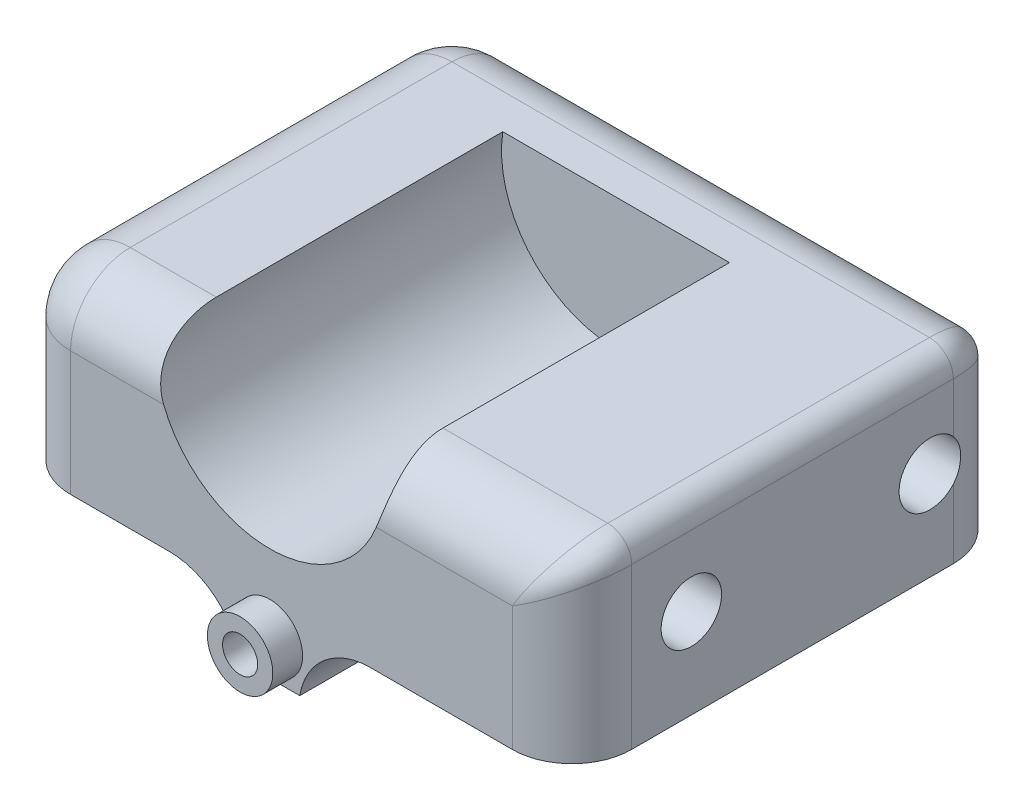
ISO-10303-21;
HEADER;
FILE_DESCRIPTION(('STEP AP214'),'2;1');
FILE_NAME('part.step','',(''),(''),'','','');
FILE_SCHEMA(('AUTOMOTIVE_DESIGN { 1 0 10303 214 1 1 1 1 }'));
ENDSEC;
DATA;
#1=APPLICATION_CONTEXT('core data for automotive mechanical design processes');
#2=APPLICATION_PROTOCOL_DEFINITION('international standard','automotive_design',2000,#1);
#3=PRODUCT_CONTEXT('',#1,'mechanical');
#4=PRODUCT('Part','Part','',(#3));
#5=PRODUCT_RELATED_PRODUCT_CATEGORY('part','',(#4));
#6=PRODUCT_DEFINITION_FORMATION('','',#4);
#7=PRODUCT_DEFINITION_CONTEXT('part definition',#1,'design');
#8=PRODUCT_DEFINITION('design','',#6,#7);
#9=PRODUCT_DEFINITION_SHAPE('','',#8);
#10=(LENGTH_UNIT() NAMED_UNIT(*) SI_UNIT(.MILLI.,.METRE.));
#11=(NAMED_UNIT(*) PLANE_ANGLE_UNIT() SI_UNIT($,.RADIAN.));
#12=(NAMED_UNIT(*) SI_UNIT($,.STERADIAN.) SOLID_ANGLE_UNIT());
#13=UNCERTAINTY_MEASURE_WITH_UNIT(LENGTH_MEASURE(1.E-05),#10,'distance_accuracy_value','');
#14=(GEOMETRIC_REPRESENTATION_CONTEXT(3) GLOBAL_UNCERTAINTY_ASSIGNED_CONTEXT((#13)) GLOBAL_UNIT_ASSIGNED_CONTEXT((#10,
#11,#12)) REPRESENTATION_CONTEXT('',''));
#15=CARTESIAN_POINT('',(0.,0.,0.));
#16=DIRECTION('',(0.,0.,1.));
#17=DIRECTION('',(1.,0.,0.));
#18=AXIS2_PLACEMENT_3D('',#15,#16,#17);
#19=CARTESIAN_POINT('',(-6.60400000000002,0.,-50.8));
#20=DIRECTION('',(0.,-1.,0.));
#21=DIRECTION('',(0.,0.,-1.));
#22=AXIS2_PLACEMENT_3D('',#19,#20,#21);
#23=PLANE('',#22);
#24=DIRECTION('',(0.,0.,-1.));
#25=VECTOR('',#24,1.);
#26=CARTESIAN_POINT('',(25.6425320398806,0.,-46.482));
#27=LINE('',#26,#25);
#28=CARTESIAN_POINT('',(25.6425320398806,0.,-46.9141939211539));
#29=VERTEX_POINT('',#28);
#30=CARTESIAN_POINT('',(25.6425320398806,0.,-49.784));
#31=VERTEX_POINT('',#30);
#32=EDGE_CURVE('E274',#29,#31,#27,.T.);
#33=ORIENTED_EDGE('',*,*,#32,.F.);
#34=DIRECTION('',(1.,0.,0.));
#35=VECTOR('',#34,1.);
#36=CARTESIAN_POINT('',(-6.60400000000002,0.,-46.9141939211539));
#37=LINE('',#36,#35);
#38=CARTESIAN_POINT('',(29.4754679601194,0.,-46.9141939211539));
#39=VERTEX_POINT('',#38);
#40=EDGE_CURVE('E344',#29,#39,#37,.T.);
#41=ORIENTED_EDGE('',*,*,#40,.T.);
#42=DIRECTION('',(0.,0.,-1.));
#43=VECTOR('',#42,1.);
#44=CARTESIAN_POINT('',(29.4754679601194,0.,-46.482));
#45=LINE('',#44,#43);
#46=CARTESIAN_POINT('',(29.4754679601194,0.,-49.784));
#47=VERTEX_POINT('',#46);
#48=EDGE_CURVE('E320',#39,#47,#45,.T.);
#49=ORIENTED_EDGE('',*,*,#48,.T.);
#50=DIRECTION('',(1.,0.,0.));
#51=VECTOR('',#50,1.);
#52=CARTESIAN_POINT('',(-6.60400000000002,0.,-49.784));
#53=LINE('',#52,#51);
#54=EDGE_CURVE('E459',#31,#47,#53,.T.);
#55=ORIENTED_EDGE('',*,*,#54,.F.);
#56=EDGE_LOOP('',(#33,#41,#49,#55));
#57=FACE_BOUND('',#56,.T.);
#58=ADVANCED_FACE('F38',(#57),#23,.F.);
#59=CARTESIAN_POINT('',(33.274,66.294,-49.784));
#60=DIRECTION('',(0.,0.,-1.));
#61=DIRECTION('',(-1.,0.,0.));
#62=AXIS2_PLACEMENT_3D('',#59,#60,#61);
#63=PLANE('',#62);
#64=CARTESIAN_POINT('',(27.559,-2.54,-49.784));
#65=DIRECTION('',(0.,0.,-1.));
#66=DIRECTION('',(-1.,0.,0.));
#67=AXIS2_PLACEMENT_3D('',#64,#65,#66);
#68=CIRCLE('',#67,1.86774069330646);
#69=CARTESIAN_POINT('',(25.6912593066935,-2.54,-49.784));
#70=VERTEX_POINT('',#69);
#71=EDGE_CURVE('E338',#70,#70,#68,.F.);
#72=ORIENTED_EDGE('',*,*,#71,.T.);
#73=EDGE_LOOP('',(#72));
#74=FACE_BOUND('',#73,.T.);
#75=CARTESIAN_POINT('',(21.844,-2.54,-49.784));
#76=DIRECTION('',(0.,0.,-1.));
#77=DIRECTION('',(-1.,0.,0.));
#78=AXIS2_PLACEMENT_3D('',#75,#76,#77);
#79=CIRCLE('',#78,2.54);
#80=CARTESIAN_POINT('',(24.384,-2.54,-49.784));
#81=VERTEX_POINT('',#80);
#82=CARTESIAN_POINT('',(24.3801658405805,-2.40049075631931,-49.784));
#83=VERTEX_POINT('',#82);
#84=EDGE_CURVE('E331',#81,#83,#79,.F.);
#85=ORIENTED_EDGE('',*,*,#84,.T.);
#86=CARTESIAN_POINT('',(27.559,-2.54,-49.784));
#87=DIRECTION('',(0.,0.,-1.));
#88=DIRECTION('',(-1.,0.,0.));
#89=AXIS2_PLACEMENT_3D('',#86,#87,#88);
#90=CIRCLE('',#89,3.18189400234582);
#91=EDGE_CURVE('E269',#83,#31,#90,.T.);
#92=ORIENTED_EDGE('',*,*,#91,.T.);
#93=ORIENTED_EDGE('',*,*,#54,.T.);
#94=CARTESIAN_POINT('',(27.559,-2.54,-49.784));
#95=DIRECTION('',(0.,0.,-1.));
#96=DIRECTION('',(-1.,0.,0.));
#97=AXIS2_PLACEMENT_3D('',#94,#95,#96);
#98=CIRCLE('',#97,3.18189400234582);
#99=CARTESIAN_POINT('',(30.7378341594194,-2.40049075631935,-49.784));
#100=VERTEX_POINT('',#99);
#101=EDGE_CURVE('E294',#47,#100,#98,.T.);
#102=ORIENTED_EDGE('',*,*,#101,.T.);
#103=CARTESIAN_POINT('',(33.274,-2.54,-49.784));
#104=DIRECTION('',(0.,0.,-1.));
#105=DIRECTION('',(-1.,0.,0.));
#106=AXIS2_PLACEMENT_3D('',#103,#104,#105);
#107=CIRCLE('',#106,2.54);
#108=CARTESIAN_POINT('',(30.734,-2.54,-49.784));
#109=VERTEX_POINT('',#108);
#110=EDGE_CURVE('E325',#100,#109,#107,.F.);
#111=ORIENTED_EDGE('',*,*,#110,.T.);
#112=DIRECTION('',(0.,1.,0.));
#113=VECTOR('',#112,1.);
#114=CARTESIAN_POINT('',(30.734,0.,-49.784));
#115=LINE('',#114,#113);
#116=CARTESIAN_POINT('',(30.734,-2.74934288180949,-49.784));
#117=VERTEX_POINT('',#116);
#118=EDGE_CURVE('E336',#117,#109,#115,.T.);
#119=ORIENTED_EDGE('',*,*,#118,.F.);
#120=CARTESIAN_POINT('',(27.559,-2.54,-49.784));
#121=DIRECTION('',(0.,0.,-1.));
#122=DIRECTION('',(-1.,0.,0.));
#123=AXIS2_PLACEMENT_3D('',#120,#121,#122);
#124=CIRCLE('',#123,3.18189400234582);
#125=CARTESIAN_POINT('',(24.384,-2.74934288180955,-49.784));
#126=VERTEX_POINT('',#125);
#127=EDGE_CURVE('E299',#117,#126,#124,.T.);
#128=ORIENTED_EDGE('',*,*,#127,.T.);
#129=DIRECTION('',(0.,-1.,0.));
#130=VECTOR('',#129,1.);
#131=CARTESIAN_POINT('',(24.384,0.,-49.784));
#132=LINE('',#131,#130);
#133=EDGE_CURVE('E333',#81,#126,#132,.T.);
#134=ORIENTED_EDGE('',*,*,#133,.F.);
#135=EDGE_LOOP('',(#85,#92,#93,#102,#111,#119,#128,#134));
#136=FACE_BOUND('',#135,.T.);
#137=ADVANCED_FACE('F541',(#74,#136),#63,.T.);
#138=CARTESIAN_POINT('',(30.734,0.,-50.8));
#139=DIRECTION('',(1.,0.,0.));
#140=DIRECTION('',(0.,0.,-1.));
#141=AXIS2_PLACEMENT_3D('',#138,#139,#140);
#142=PLANE('',#141);
#143=DIRECTION('',(0.,-1.,0.));
#144=VECTOR('',#143,1.);
#145=CARTESIAN_POINT('',(30.734,0.,-46.482));
#146=LINE('',#145,#144);
#147=CARTESIAN_POINT('',(30.734,-2.74934288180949,-46.482));
#148=VERTEX_POINT('',#147);
#149=CARTESIAN_POINT('',(30.734,-6.35,-46.482));
#150=VERTEX_POINT('',#149);
#151=EDGE_CURVE('E298',#148,#150,#146,.T.);
#152=ORIENTED_EDGE('',*,*,#151,.F.);
#153=DIRECTION('',(0.,0.,-1.));
#154=VECTOR('',#153,1.);
#155=CARTESIAN_POINT('',(30.734,-2.74934288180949,-46.482));
#156=LINE('',#155,#154);
#157=EDGE_CURVE('E306',#148,#117,#156,.T.);
#158=ORIENTED_EDGE('',*,*,#157,.T.);
#159=ORIENTED_EDGE('',*,*,#118,.T.);
#160=DIRECTION('',(0.,0.,1.));
#161=VECTOR('',#160,1.);
#162=CARTESIAN_POINT('',(30.734,-2.54,-40.64));
#163=LINE('',#162,#161);
#164=CARTESIAN_POINT('',(30.734,-2.54,-39.959409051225));
#165=VERTEX_POINT('',#164);
#166=EDGE_CURVE('E435',#109,#165,#163,.T.);
#167=ORIENTED_EDGE('',*,*,#166,.T.);
#168=CARTESIAN_POINT('',(30.734,-5.08,-35.56));
#169=DIRECTION('',(1.,0.,0.));
#170=DIRECTION('',(0.,0.,-1.));
#171=AXIS2_PLACEMENT_3D('',#168,#169,#170);
#172=CIRCLE('',#171,5.08);
#173=CARTESIAN_POINT('',(30.734,-5.08,-40.64));
#174=VERTEX_POINT('',#173);
#175=EDGE_CURVE('E506',#165,#174,#172,.F.);
#176=ORIENTED_EDGE('',*,*,#175,.T.);
#177=DIRECTION('',(0.,1.,0.));
#178=VECTOR('',#177,1.);
#179=CARTESIAN_POINT('',(30.734,0.,-40.64));
#180=LINE('',#179,#178);
#181=CARTESIAN_POINT('',(30.734,-6.35,-40.64));
#182=VERTEX_POINT('',#181);
#183=EDGE_CURVE('E382',#182,#174,#180,.T.);
#184=ORIENTED_EDGE('',*,*,#183,.F.);
#185=DIRECTION('',(0.,0.,1.));
#186=VECTOR('',#185,1.);
#187=CARTESIAN_POINT('',(30.734,-6.35,-50.8));
#188=LINE('',#187,#186);
#189=EDGE_CURVE('E393',#150,#182,#188,.T.);
#190=ORIENTED_EDGE('',*,*,#189,.F.);
#191=EDGE_LOOP('',(#152,#158,#159,#167,#176,#184,#190));
#192=FACE_BOUND('',#191,.T.);
#193=ADVANCED_FACE('F538',(#192),#142,.T.);
#194=CARTESIAN_POINT('',(30.734,-6.35,-50.8));
#195=DIRECTION('',(0.,-1.,0.));
#196=DIRECTION('',(1.,0.,0.));
#197=AXIS2_PLACEMENT_3D('',#194,#195,#196);
#198=PLANE('',#197);
#199=DIRECTION('',(0.,0.,1.));
#200=VECTOR('',#199,1.);
#201=CARTESIAN_POINT('',(24.384,-6.35,-50.8));
#202=LINE('',#201,#200);
#203=CARTESIAN_POINT('',(24.384,-6.35,-46.482));
#204=VERTEX_POINT('',#203);
#205=CARTESIAN_POINT('',(24.384,-6.35,-40.64));
#206=VERTEX_POINT('',#205);
#207=EDGE_CURVE('E397',#204,#206,#202,.T.);
#208=ORIENTED_EDGE('',*,*,#207,.F.);
#209=DIRECTION('',(-1.,0.,0.));
#210=VECTOR('',#209,1.);
#211=CARTESIAN_POINT('',(0.,-6.35,-46.482));
#212=LINE('',#211,#210);
#213=EDGE_CURVE('E301',#150,#204,#212,.T.);
#214=ORIENTED_EDGE('',*,*,#213,.F.);
#215=ORIENTED_EDGE('',*,*,#189,.T.);
#216=DIRECTION('',(-1.,0.,0.));
#217=VECTOR('',#216,1.);
#218=CARTESIAN_POINT('',(75.184,-6.35,-40.64));
#219=LINE('',#218,#217);
#220=EDGE_CURVE('E378',#182,#206,#219,.T.);
#221=ORIENTED_EDGE('',*,*,#220,.T.);
#222=EDGE_LOOP('',(#208,#214,#215,#221));
#223=FACE_BOUND('',#222,.T.);
#224=ADVANCED_FACE('F533',(#223),#198,.T.);
#225=CARTESIAN_POINT('',(24.384,0.,-50.8));
#226=DIRECTION('',(-1.,0.,0.));
#227=DIRECTION('',(0.,0.,1.));
#228=AXIS2_PLACEMENT_3D('',#225,#226,#227);
#229=PLANE('',#228);
#230=ORIENTED_EDGE('',*,*,#133,.T.);
#231=DIRECTION('',(0.,0.,-1.));
#232=VECTOR('',#231,1.);
#233=CARTESIAN_POINT('',(24.384,-2.74934288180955,-46.482));
#234=LINE('',#233,#232);
#235=CARTESIAN_POINT('',(24.384,-2.74934288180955,-46.482));
#236=VERTEX_POINT('',#235);
#237=EDGE_CURVE('E292',#236,#126,#234,.T.);
#238=ORIENTED_EDGE('',*,*,#237,.F.);
#239=DIRECTION('',(0.,1.,0.));
#240=VECTOR('',#239,1.);
#241=CARTESIAN_POINT('',(24.384,0.,-46.482));
#242=LINE('',#241,#240);
#243=EDGE_CURVE('E303',#204,#236,#242,.T.);
#244=ORIENTED_EDGE('',*,*,#243,.F.);
#245=ORIENTED_EDGE('',*,*,#207,.T.);
#246=DIRECTION('',(0.,-1.,0.));
#247=VECTOR('',#246,1.);
#248=CARTESIAN_POINT('',(24.384,0.,-40.64));
#249=LINE('',#248,#247);
#250=CARTESIAN_POINT('',(24.384,-5.08,-40.64));
#251=VERTEX_POINT('',#250);
#252=EDGE_CURVE('E376',#251,#206,#249,.T.);
#253=ORIENTED_EDGE('',*,*,#252,.F.);
#254=CARTESIAN_POINT('',(24.384,-5.08,-35.56));
#255=DIRECTION('',(-1.,0.,0.));
#256=DIRECTION('',(0.,0.,1.));
#257=AXIS2_PLACEMENT_3D('',#254,#255,#256);
#258=CIRCLE('',#257,5.08);
#259=CARTESIAN_POINT('',(24.384,-2.54,-39.959409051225));
#260=VERTEX_POINT('',#259);
#261=EDGE_CURVE('E467',#251,#260,#258,.F.);
#262=ORIENTED_EDGE('',*,*,#261,.T.);
#263=DIRECTION('',(0.,0.,1.));
#264=VECTOR('',#263,1.);
#265=CARTESIAN_POINT('',(24.384,-2.54,-50.8));
#266=LINE('',#265,#264);
#267=EDGE_CURVE('E432',#260,#81,#266,.F.);
#268=ORIENTED_EDGE('',*,*,#267,.T.);
#269=EDGE_LOOP('',(#230,#238,#244,#245,#253,#262,#268));
#270=FACE_BOUND('',#269,.T.);
#271=ADVANCED_FACE('F534',(#270),#229,.T.);
#272=CARTESIAN_POINT('',(21.844,-2.54,-50.8));
#273=DIRECTION('',(0.,0.,-1.));
#274=DIRECTION('',(-1.,0.,0.));
#275=AXIS2_PLACEMENT_3D('',#272,#273,#274);
#276=CYLINDRICAL_SURFACE('',#275,2.54);
#277=DIRECTION('',(0.,0.,-1.));
#278=VECTOR('',#277,1.);
#279=CARTESIAN_POINT('',(24.3801658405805,-2.40049075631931,-46.482));
#280=LINE('',#279,#278);
#281=CARTESIAN_POINT('',(24.3801658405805,-2.40049075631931,-46.482));
#282=VERTEX_POINT('',#281);
#283=EDGE_CURVE('E262',#282,#83,#280,.T.);
#284=ORIENTED_EDGE('',*,*,#283,.T.);
#285=ORIENTED_EDGE('',*,*,#84,.F.);
#286=ORIENTED_EDGE('',*,*,#267,.F.);
#287=CARTESIAN_POINT('',(24.384,-2.54,-39.959409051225));
#288=CARTESIAN_POINT('',(24.3840006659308,-2.44485372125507,-39.9045158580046));
#289=CARTESIAN_POINT('',(24.3786579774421,-2.35163220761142,-39.846542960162));
#290=CARTESIAN_POINT('',(24.3585659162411,-2.17003262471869,-39.7253667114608));
#291=CARTESIAN_POINT('',(24.3438403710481,-2.08164290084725,-39.6621769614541));
#292=CARTESIAN_POINT('',(24.3064988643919,-1.91134722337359,-39.5320778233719));
#293=CARTESIAN_POINT('',(24.2839900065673,-1.82937089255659,-39.4652287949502));
#294=CARTESIAN_POINT('',(24.232144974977,-1.67090995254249,-39.3276937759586));
#295=CARTESIAN_POINT('',(24.2028037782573,-1.59442943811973,-39.2570049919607));
#296=CARTESIAN_POINT('',(24.1321661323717,-1.43318050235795,-39.0986702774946));
#297=CARTESIAN_POINT('',(24.0896573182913,-1.34960050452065,-39.0103553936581));
#298=CARTESIAN_POINT('',(23.997864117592,-1.19059416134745,-38.8300736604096));
#299=CARTESIAN_POINT('',(23.9485795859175,-1.11516799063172,-38.7381067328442));
#300=CARTESIAN_POINT('',(23.7918002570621,-0.900092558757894,-38.4566715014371));
#301=CARTESIAN_POINT('',(23.6757952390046,-0.772535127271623,-38.2625572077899));
#302=CARTESIAN_POINT('',(23.4656551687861,-0.581537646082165,-37.9255557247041));
#303=CARTESIAN_POINT('',(23.3752492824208,-0.510304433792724,-37.7845656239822));
#304=CARTESIAN_POINT('',(23.1888403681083,-0.382272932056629,-37.4996242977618));
#305=CARTESIAN_POINT('',(23.0928348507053,-0.325481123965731,-37.3556717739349));
#306=CARTESIAN_POINT('',(22.8969725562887,-0.225933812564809,-37.0659479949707));
#307=CARTESIAN_POINT('',(22.7971218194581,-0.183157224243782,-36.9201798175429));
#308=CARTESIAN_POINT('',(22.5947087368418,-0.111097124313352,-36.6273009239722));
#309=CARTESIAN_POINT('',(22.4921475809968,-0.0818077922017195,-36.4801908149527));
#310=CARTESIAN_POINT('',(22.3001075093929,-0.0396391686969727,-36.20617603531));
#311=CARTESIAN_POINT('',(22.2108476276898,-0.0250158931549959,-36.0793801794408));
#312=CARTESIAN_POINT('',(22.031796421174,-0.00535342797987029,-35.8255926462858));
#313=CARTESIAN_POINT('',(21.9420057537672,-0.00030417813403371,-35.698601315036));
#314=CARTESIAN_POINT('',(21.849486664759,-4.44575053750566E-06,-35.56775931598));
#315=CARTESIAN_POINT('',(21.8467433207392,-1.47339299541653E-09,-35.563879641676));
#316=CARTESIAN_POINT('',(21.844,0.,-35.56));
#317=B_SPLINE_CURVE_WITH_KNOTS('',3,(#287,#288,#289,#290,#291,#292,#293,#294,#295,#296,#297,
#298,#299,#300,#301,#302,#303,#304,#305,#306,#307,#308,#309,#310,#311,#312,#313,#314,#315,#316),
.UNSPECIFIED.,.F.,.F.,(4,2,2,2,2,2,2,2,2,2,2,2,2,2,4),(0.,0.329163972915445,0.657495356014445,
0.981477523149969,1.3056986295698,1.69155574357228,2.07742111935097,2.85307580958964,
3.39849536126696,3.94415926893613,4.48899844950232,5.03360228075,5.5005791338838,
5.9670650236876,5.98131985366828),.UNSPECIFIED.);
#318=CARTESIAN_POINT('',(21.844,0.,-35.56));
#319=VERTEX_POINT('',#318);
#320=EDGE_CURVE('E470',#260,#319,#317,.T.);
#321=ORIENTED_EDGE('',*,*,#320,.T.);
#322=DIRECTION('',(0.,0.,1.));
#323=VECTOR('',#322,1.);
#324=CARTESIAN_POINT('',(21.844,0.,-40.64));
#325=LINE('',#324,#323);
#326=CARTESIAN_POINT('',(21.844,0.,-46.482));
#327=VERTEX_POINT('',#326);
#328=EDGE_CURVE('E286',#327,#319,#325,.T.);
#329=ORIENTED_EDGE('',*,*,#328,.F.);
#330=CARTESIAN_POINT('',(21.844,-2.54,-46.482));
#331=DIRECTION('',(0.,0.,-1.));
#332=DIRECTION('',(-1.,0.,0.));
#333=AXIS2_PLACEMENT_3D('',#330,#331,#332);
#334=CIRCLE('',#333,2.54);
#335=EDGE_CURVE('E280',#282,#327,#334,.F.);
#336=ORIENTED_EDGE('',*,*,#335,.F.);
#337=EDGE_LOOP('',(#284,#285,#286,#321,#329,#336));
#338=FACE_BOUND('',#337,.T.);
#339=ADVANCED_FACE('F284',(#338),#276,.F.);
#340=CARTESIAN_POINT('',(33.274,-2.54,-50.8));
#341=DIRECTION('',(0.,0.,-1.));
#342=DIRECTION('',(-1.,0.,0.));
#343=AXIS2_PLACEMENT_3D('',#340,#341,#342);
#344=CYLINDRICAL_SURFACE('',#343,2.54);
#345=DIRECTION('',(0.,0.,-1.));
#346=VECTOR('',#345,1.);
#347=CARTESIAN_POINT('',(30.7378341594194,-2.40049075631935,-46.482));
#348=LINE('',#347,#346);
#349=CARTESIAN_POINT('',(30.7378341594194,-2.40049075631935,-46.482));
#350=VERTEX_POINT('',#349);
#351=EDGE_CURVE('E323',#350,#100,#348,.T.);
#352=ORIENTED_EDGE('',*,*,#351,.F.);
#353=CARTESIAN_POINT('',(33.274,-2.54,-46.482));
#354=DIRECTION('',(0.,0.,-1.));
#355=DIRECTION('',(-1.,0.,0.));
#356=AXIS2_PLACEMENT_3D('',#353,#354,#355);
#357=CIRCLE('',#356,2.54);
#358=CARTESIAN_POINT('',(33.274,0.,-46.482));
#359=VERTEX_POINT('',#358);
#360=EDGE_CURVE('E317',#359,#350,#357,.F.);
#361=ORIENTED_EDGE('',*,*,#360,.F.);
#362=DIRECTION('',(0.,0.,1.));
#363=VECTOR('',#362,1.);
#364=CARTESIAN_POINT('',(33.274,0.,-50.8));
#365=LINE('',#364,#363);
#366=CARTESIAN_POINT('',(33.274,0.,-35.56));
#367=VERTEX_POINT('',#366);
#368=EDGE_CURVE('E428',#367,#359,#365,.F.);
#369=ORIENTED_EDGE('',*,*,#368,.F.);
#370=CARTESIAN_POINT('',(30.734,-2.54,-39.959409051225));
#371=CARTESIAN_POINT('',(30.7339993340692,-2.44485372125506,-39.9045158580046));
#372=CARTESIAN_POINT('',(30.7393420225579,-2.3516322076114,-39.846542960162));
#373=CARTESIAN_POINT('',(30.759434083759,-2.17003262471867,-39.7253667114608));
#374=CARTESIAN_POINT('',(30.7741596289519,-2.08164290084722,-39.6621769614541));
#375=CARTESIAN_POINT('',(30.8115011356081,-1.91134722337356,-39.5320778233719));
#376=CARTESIAN_POINT('',(30.8340099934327,-1.82937089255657,-39.4652287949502));
#377=CARTESIAN_POINT('',(30.885855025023,-1.67090995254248,-39.3276937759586));
#378=CARTESIAN_POINT('',(30.9151962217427,-1.59442943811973,-39.2570049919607));
#379=CARTESIAN_POINT('',(30.9858338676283,-1.43318050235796,-39.0986702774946));
#380=CARTESIAN_POINT('',(31.0283426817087,-1.34960050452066,-39.0103553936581));
#381=CARTESIAN_POINT('',(31.120135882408,-1.19059416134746,-38.8300736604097));
#382=CARTESIAN_POINT('',(31.1694204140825,-1.11516799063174,-38.7381067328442));
#383=CARTESIAN_POINT('',(31.3261997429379,-0.900092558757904,-38.4566715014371));
#384=CARTESIAN_POINT('',(31.4422047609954,-0.772535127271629,-38.2625572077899));
#385=CARTESIAN_POINT('',(31.6523448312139,-0.581537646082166,-37.9255557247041));
#386=CARTESIAN_POINT('',(31.7427507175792,-0.510304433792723,-37.7845656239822));
#387=CARTESIAN_POINT('',(31.9291596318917,-0.382272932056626,-37.4996242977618));
#388=CARTESIAN_POINT('',(32.0251651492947,-0.325481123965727,-37.3556717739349));
#389=CARTESIAN_POINT('',(32.2210274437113,-0.225933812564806,-37.0659479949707));
#390=CARTESIAN_POINT('',(32.3208781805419,-0.183157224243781,-36.9201798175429));
#391=CARTESIAN_POINT('',(32.5232912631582,-0.111097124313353,-36.6273009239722));
#392=CARTESIAN_POINT('',(32.6258524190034,-0.0818077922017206,-36.4801908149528));
#393=CARTESIAN_POINT('',(32.817892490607,-0.0396391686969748,-36.2061760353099));
#394=CARTESIAN_POINT('',(32.9071523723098,-0.025015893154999,-36.0793801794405));
#395=CARTESIAN_POINT('',(33.0862035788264,-0.00535342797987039,-35.825592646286));
#396=CARTESIAN_POINT('',(33.1759942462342,-0.000304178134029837,-35.698601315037));
#397=CARTESIAN_POINT('',(33.268513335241,-4.44575053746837E-06,-35.5677593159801));
#398=CARTESIAN_POINT('',(33.2712566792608,-1.4733930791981E-09,-35.563879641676));
#399=CARTESIAN_POINT('',(33.274,0.,-35.56));
#400=B_SPLINE_CURVE_WITH_KNOTS('',3,(#370,#371,#372,#373,#374,#375,#376,#377,#378,#379,#380,
#381,#382,#383,#384,#385,#386,#387,#388,#389,#390,#391,#392,#393,#394,#395,#396,#397,#398,#399),
.UNSPECIFIED.,.F.,.F.,(4,2,2,2,2,2,2,2,2,2,2,2,2,2,4),(0.,0.329163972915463,0.657495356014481,
0.981477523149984,1.3056986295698,1.69155574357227,2.07742111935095,2.85307580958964,
3.39849536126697,3.94415926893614,4.48899844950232,5.03360228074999,5.50057913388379,
5.96706502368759,5.98131985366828),.UNSPECIFIED.);
#401=EDGE_CURVE('E477',#367,#165,#400,.F.);
#402=ORIENTED_EDGE('',*,*,#401,.T.);
#403=ORIENTED_EDGE('',*,*,#166,.F.);
#404=ORIENTED_EDGE('',*,*,#110,.F.);
#405=EDGE_LOOP('',(#352,#361,#369,#402,#403,#404));
#406=FACE_BOUND('',#405,.T.);
#407=ADVANCED_FACE('F515',(#406),#344,.F.);
#408=CARTESIAN_POINT('',(27.559,-2.54,-50.8));
#409=DIRECTION('',(0.,0.,1.));
#410=DIRECTION('',(1.,0.,0.));
#411=AXIS2_PLACEMENT_3D('',#408,#409,#410);
#412=CYLINDRICAL_SURFACE('',#411,1.86774069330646);
#413=CARTESIAN_POINT('',(29.4076745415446,-2.80619116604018,-40.1027077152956));
#414=CARTESIAN_POINT('',(29.3940123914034,-2.9010407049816,-40.1501791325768));
#415=CARTESIAN_POINT('',(29.3727787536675,-2.9966063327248,-40.1942692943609));
#416=CARTESIAN_POINT('',(29.3142371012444,-3.18609354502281,-40.2748848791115));
#417=CARTESIAN_POINT('',(29.2769184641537,-3.28001400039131,-40.3114052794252));
#418=CARTESIAN_POINT('',(29.1860035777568,-3.46291045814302,-40.3767290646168));
#419=CARTESIAN_POINT('',(29.1323637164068,-3.55187244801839,-40.4055113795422));
#420=CARTESIAN_POINT('',(29.0097923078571,-3.72091152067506,-40.4556170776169));
#421=CARTESIAN_POINT('',(28.9408638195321,-3.80099037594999,-40.4769419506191));
#422=CARTESIAN_POINT('',(28.7931761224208,-3.94550179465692,-40.512231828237));
#423=CARTESIAN_POINT('',(28.7150353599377,-4.01049489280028,-40.5264969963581));
#424=CARTESIAN_POINT('',(28.5487429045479,-4.12719325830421,-40.5502019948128));
#425=CARTESIAN_POINT('',(28.4605910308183,-4.17889828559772,-40.5596417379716));
#426=CARTESIAN_POINT('',(28.2768363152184,-4.26729782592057,-40.5747716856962));
#427=CARTESIAN_POINT('',(28.1812380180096,-4.30400141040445,-40.5804641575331));
#428=CARTESIAN_POINT('',(27.9852141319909,-4.36132553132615,-40.5889911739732));
#429=CARTESIAN_POINT('',(27.8847882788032,-4.38194518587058,-40.5918255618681));
#430=CARTESIAN_POINT('',(27.6804763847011,-4.40666337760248,-40.5951941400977));
#431=CARTESIAN_POINT('',(27.5765617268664,-4.4105302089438,-40.5956960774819));
#432=CARTESIAN_POINT('',(27.3695376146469,-4.4009937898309,-40.5944187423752));
#433=CARTESIAN_POINT('',(27.2664282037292,-4.3875896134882,-40.5926393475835));
#434=CARTESIAN_POINT('',(27.0634982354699,-4.34381579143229,-40.5864221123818));
#435=CARTESIAN_POINT('',(26.9636933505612,-4.31337496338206,-40.5819731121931));
#436=CARTESIAN_POINT('',(26.7707106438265,-4.23642089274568,-40.5696191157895));
#437=CARTESIAN_POINT('',(26.6775325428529,-4.18990832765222,-40.5617142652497));
#438=CARTESIAN_POINT('',(26.5011015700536,-4.08268961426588,-40.5414372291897));
#439=CARTESIAN_POINT('',(26.4177882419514,-4.02207748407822,-40.5290943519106));
#440=CARTESIAN_POINT('',(26.2628053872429,-3.8886240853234,-40.4987942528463));
#441=CARTESIAN_POINT('',(26.1911335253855,-3.81578527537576,-40.4808381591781));
#442=CARTESIAN_POINT('',(26.0622796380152,-3.66170623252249,-40.438638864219));
#443=CARTESIAN_POINT('',(26.0049039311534,-3.58060199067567,-40.414489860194));
#444=CARTESIAN_POINT('',(25.9044895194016,-3.41216176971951,-40.3592252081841));
#445=CARTESIAN_POINT('',(25.8614501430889,-3.32482608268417,-40.3281098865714));
#446=CARTESIAN_POINT('',(25.7897091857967,-3.14615843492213,-40.2585033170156));
#447=CARTESIAN_POINT('',(25.761153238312,-3.05479554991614,-40.2199423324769));
#448=CARTESIAN_POINT('',(25.7185670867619,-2.87181073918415,-40.1360729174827));
#449=CARTESIAN_POINT('',(25.7045417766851,-2.78018873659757,-40.0907622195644));
#450=CARTESIAN_POINT('',(25.6893724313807,-2.59147013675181,-39.9901229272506));
#451=CARTESIAN_POINT('',(25.689409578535,-2.49456028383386,-39.9342725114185));
#452=CARTESIAN_POINT('',(25.7036184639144,-2.3054305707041,-39.8168283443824));
#453=CARTESIAN_POINT('',(25.7177954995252,-2.21321248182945,-39.7552324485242));
#454=CARTESIAN_POINT('',(25.7620335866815,-2.01956904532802,-39.6166780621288));
#455=CARTESIAN_POINT('',(25.7943954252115,-1.919264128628,-39.5388932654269));
#456=CARTESIAN_POINT('',(25.8737726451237,-1.72808766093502,-39.3792483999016));
#457=CARTESIAN_POINT('',(25.9208070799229,-1.63722858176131,-39.2973831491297));
#458=CARTESIAN_POINT('',(26.0395036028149,-1.44694876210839,-39.1136368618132));
#459=CARTESIAN_POINT('',(26.1142923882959,-1.34992901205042,-39.0112575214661));
#460=CARTESIAN_POINT('',(26.2400046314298,-1.21620304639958,-38.8587994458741));
#461=CARTESIAN_POINT('',(26.284171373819,-1.17358936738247,-38.8081575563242));
#462=CARTESIAN_POINT('',(26.3771716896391,-1.09239963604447,-38.7079498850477));
#463=CARTESIAN_POINT('',(26.4260030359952,-1.05382167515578,-38.6583836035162));
#464=CARTESIAN_POINT('',(26.5382482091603,-0.974075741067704,-38.5521529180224));
#465=CARTESIAN_POINT('',(26.6026795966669,-0.933778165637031,-38.4958999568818));
#466=CARTESIAN_POINT('',(26.7393843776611,-0.859905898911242,-38.3886778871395));
#467=CARTESIAN_POINT('',(26.8116490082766,-0.826323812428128,-38.33770299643));
#468=CARTESIAN_POINT('',(26.9451498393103,-0.774967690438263,-38.2571762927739));
#469=CARTESIAN_POINT('',(27.0043716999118,-0.755353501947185,-38.2254997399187));
#470=CARTESIAN_POINT('',(27.1278338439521,-0.721587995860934,-38.1699239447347));
#471=CARTESIAN_POINT('',(27.1920630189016,-0.707424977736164,-38.146008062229));
#472=CARTESIAN_POINT('',(27.3101634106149,-0.688166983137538,-38.1131329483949));
#473=CARTESIAN_POINT('',(27.3632156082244,-0.6817642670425,-38.1020435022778));
#474=CARTESIAN_POINT('',(27.4707147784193,-0.673571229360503,-38.0878167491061));
#475=CARTESIAN_POINT('',(27.5251601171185,-0.671775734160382,-38.0846705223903));
#476=CARTESIAN_POINT('',(27.6338786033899,-0.672968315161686,-38.0867513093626));
#477=CARTESIAN_POINT('',(27.6881515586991,-0.675960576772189,-38.0919856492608));
#478=CARTESIAN_POINT('',(27.794956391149,-0.686443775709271,-38.1101311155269));
#479=CARTESIAN_POINT('',(27.8474860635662,-0.693940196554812,-38.1230515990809));
#480=CARTESIAN_POINT('',(27.9699928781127,-0.716594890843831,-38.1614921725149));
#481=CARTESIAN_POINT('',(28.0386807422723,-0.733608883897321,-38.1899716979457));
#482=CARTESIAN_POINT('',(28.1701347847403,-0.773725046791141,-38.2551545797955));
#483=CARTESIAN_POINT('',(28.2328831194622,-0.796844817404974,-38.2918816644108));
#484=CARTESIAN_POINT('',(28.3438945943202,-0.844277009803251,-38.364756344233));
#485=CARTESIAN_POINT('',(28.3929297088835,-0.867911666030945,-38.400191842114));
#486=CARTESIAN_POINT('',(28.4872795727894,-0.918391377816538,-38.4736589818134));
#487=CARTESIAN_POINT('',(28.5325917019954,-0.945238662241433,-38.5116924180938));
#488=CARTESIAN_POINT('',(28.6635638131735,-1.03027414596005,-38.6284441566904));
#489=CARTESIAN_POINT('',(28.7441241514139,-1.09289574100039,-38.7097185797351));
#490=CARTESIAN_POINT('',(28.8685845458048,-1.20657367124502,-38.8475810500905));
#491=CARTESIAN_POINT('',(28.9158759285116,-1.25474825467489,-38.9035823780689));
#492=CARTESIAN_POINT('',(29.0049141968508,-1.35580065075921,-39.0157843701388));
#493=CARTESIAN_POINT('',(29.0466590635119,-1.40868016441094,-39.0719850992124));
#494=CARTESIAN_POINT('',(29.1632970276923,-1.57413805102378,-39.2396559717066));
#495=CARTESIAN_POINT('',(29.2297709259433,-1.69369793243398,-39.3503960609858));
#496=CARTESIAN_POINT('',(29.3254959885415,-1.92348563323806,-39.542523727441));
#497=CARTESIAN_POINT('',(29.359586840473,-2.03059167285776,-39.6252705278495));
#498=CARTESIAN_POINT('',(29.4082195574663,-2.25396197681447,-39.7835611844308));
#499=CARTESIAN_POINT('',(29.4228255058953,-2.37019488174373,-39.8591278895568));
#500=CARTESIAN_POINT('',(29.4274615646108,-2.541310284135,-39.9605820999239));
#501=CARTESIAN_POINT('',(29.4267173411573,-2.59372611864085,-39.9904027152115));
#502=CARTESIAN_POINT('',(29.4206783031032,-2.69941543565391,-40.0480774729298));
#503=CARTESIAN_POINT('',(29.4153809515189,-2.75268938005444,-40.0759305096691));
#504=CARTESIAN_POINT('',(29.4076745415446,-2.80619116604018,-40.1027077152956));
#505=B_SPLINE_CURVE_WITH_KNOTS('',3,(#413,#414,#415,#416,#417,#418,#419,#420,#421,#422,#423,
#424,#425,#426,#427,#428,#429,#430,#431,#432,#433,#434,#435,#436,#437,#438,#439,#440,#441,#442,
#443,#444,#445,#446,#447,#448,#449,#450,#451,#452,#453,#454,#455,#456,#457,#458,#459,#460,#461,
#462,#463,#464,#465,#466,#467,#468,#469,#470,#471,#472,#473,#474,#475,#476,#477,#478,#479,#480,
#481,#482,#483,#484,#485,#486,#487,#488,#489,#490,#491,#492,#493,#494,#495,#496,#497,#498,#499,
#500,#501,#502,#503,#504),.UNSPECIFIED.,.T.,.F.,(4,2,2,2,2,2,2,2,2,2,2,2,2,2,2,2,2,2,2,2,2,2,2,
2,2,2,2,2,2,2,2,2,2,2,2,2,2,2,2,2,2,2,2,2,2,4),(0.,0.320624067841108,0.641460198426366,
0.963161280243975,1.28479805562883,1.59123635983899,1.89768019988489,2.20393845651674,
2.51021350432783,2.82071134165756,3.13122582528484,3.44304748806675,3.75485600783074,
4.06464209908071,4.37436597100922,4.67963257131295,4.98488487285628,5.29314854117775,
5.60151600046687,5.93579022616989,6.27018973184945,6.66174643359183,7.05381373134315,
7.53071034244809,7.76923187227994,8.00764008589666,8.2907451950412,8.57353680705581,
8.78283837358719,8.99168815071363,9.15471867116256,9.31756603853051,9.48055584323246,
9.64374448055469,9.87129130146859,10.0995013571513,10.2940831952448,10.48880082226,
10.8787590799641,11.1416328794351,11.404602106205,11.9296109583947,12.3468562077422,
12.7627257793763,12.943479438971,13.1243338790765),.UNSPECIFIED.);
#506=CARTESIAN_POINT('',(29.4076745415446,-2.80619116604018,-40.1027077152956));
#507=VERTEX_POINT('',#506);
#508=EDGE_CURVE('E379',#507,#507,#505,.T.);
#509=ORIENTED_EDGE('',*,*,#508,.F.);
#510=EDGE_LOOP('',(#509));
#511=FACE_BOUND('',#510,.T.);
#512=ORIENTED_EDGE('',*,*,#71,.F.);
#513=EDGE_LOOP('',(#512));
#514=FACE_BOUND('',#513,.T.);
#515=ADVANCED_FACE('F509',(#511,#514),#412,.F.);
#516=CARTESIAN_POINT('',(0.,0.,0.));
#517=DIRECTION('',(0.,0.,-1.));
#518=DIRECTION('',(-1.,0.,0.));
#519=AXIS2_PLACEMENT_3D('',#516,#517,#518);
#520=PLANE('',#519);
#521=CARTESIAN_POINT('',(27.559,-2.54,0.));
#522=DIRECTION('',(0.,0.,-1.));
#523=DIRECTION('',(-1.,0.,0.));
#524=AXIS2_PLACEMENT_3D('',#521,#522,#523);
#525=CIRCLE('',#524,3.47909921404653);
#526=CARTESIAN_POINT('',(24.0799007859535,-2.54,0.));
#527=VERTEX_POINT('',#526);
#528=EDGE_CURVE('E352',#527,#527,#525,.T.);
#529=ORIENTED_EDGE('',*,*,#528,.T.);
#530=EDGE_LOOP('',(#529));
#531=FACE_BOUND('',#530,.T.);
#532=DIRECTION('',(1.,0.,0.));
#533=VECTOR('',#532,1.);
#534=CARTESIAN_POINT('',(0.,13.2289453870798,0.));
#535=LINE('',#534,#533);
#536=CARTESIAN_POINT('',(16.2482632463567,13.2289453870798,0.));
#537=VERTEX_POINT('',#536);
#538=CARTESIAN_POINT('',(6.35,13.2289453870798,0.));
#539=VERTEX_POINT('',#538);
#540=EDGE_CURVE('E634',#537,#539,#535,.F.);
#541=ORIENTED_EDGE('',*,*,#540,.T.);
#542=DIRECTION('',(0.,-1.,0.));
#543=VECTOR('',#542,1.);
#544=CARTESIAN_POINT('',(6.35,0.,0.));
#545=LINE('',#544,#543);
#546=CARTESIAN_POINT('',(6.35,0.,0.));
#547=VERTEX_POINT('',#546);
#548=EDGE_CURVE('E63',#539,#547,#545,.T.);
#549=ORIENTED_EDGE('',*,*,#548,.T.);
#550=DIRECTION('',(1.,0.,0.));
#551=VECTOR('',#550,1.);
#552=CARTESIAN_POINT('',(0.,0.,0.));
#553=LINE('',#552,#551);
#554=CARTESIAN_POINT('',(16.8705786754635,0.,0.));
#555=VERTEX_POINT('',#554);
#556=EDGE_CURVE('E403',#547,#555,#553,.T.);
#557=ORIENTED_EDGE('',*,*,#556,.T.);
#558=CARTESIAN_POINT('',(16.8705786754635,-7.62,0.));
#559=DIRECTION('',(0.,0.,-1.));
#560=DIRECTION('',(-1.,0.,0.));
#561=AXIS2_PLACEMENT_3D('',#558,#559,#560);
#562=CIRCLE('',#561,7.62);
#563=CARTESIAN_POINT('',(24.384,-6.35,0.));
#564=VERTEX_POINT('',#563);
#565=EDGE_CURVE('E440',#555,#564,#562,.T.);
#566=ORIENTED_EDGE('',*,*,#565,.T.);
#567=DIRECTION('',(1.,0.,0.));
#568=VECTOR('',#567,1.);
#569=CARTESIAN_POINT('',(30.734,-6.35,0.));
#570=LINE('',#569,#568);
#571=CARTESIAN_POINT('',(30.734,-6.35,0.));
#572=VERTEX_POINT('',#571);
#573=EDGE_CURVE('E389',#564,#572,#570,.T.);
#574=ORIENTED_EDGE('',*,*,#573,.T.);
#575=CARTESIAN_POINT('',(38.2474213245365,-7.62,0.));
#576=DIRECTION('',(0.,0.,-1.));
#577=DIRECTION('',(-1.,0.,0.));
#578=AXIS2_PLACEMENT_3D('',#575,#576,#577);
#579=CIRCLE('',#578,7.62);
#580=CARTESIAN_POINT('',(38.2474213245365,0.,0.));
#581=VERTEX_POINT('',#580);
#582=EDGE_CURVE('E418',#572,#581,#579,.T.);
#583=ORIENTED_EDGE('',*,*,#582,.T.);
#584=CARTESIAN_POINT('',(53.34,0.,0.));
#585=VERTEX_POINT('',#584);
#586=EDGE_CURVE('E402',#581,#585,#553,.T.);
#587=ORIENTED_EDGE('',*,*,#586,.T.);
#588=DIRECTION('',(0.,1.,0.));
#589=VECTOR('',#588,1.);
#590=CARTESIAN_POINT('',(53.34,17.0389453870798,0.));
#591=LINE('',#590,#589);
#592=CARTESIAN_POINT('',(53.34,13.2289453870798,0.));
#593=VERTEX_POINT('',#592);
#594=EDGE_CURVE('E743',#585,#593,#591,.T.);
#595=ORIENTED_EDGE('',*,*,#594,.T.);
#596=DIRECTION('',(1.,0.,0.));
#597=VECTOR('',#596,1.);
#598=CARTESIAN_POINT('',(0.,13.2289453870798,0.));
#599=LINE('',#598,#597);
#600=CARTESIAN_POINT('',(38.8697367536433,13.2289453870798,0.));
#601=VERTEX_POINT('',#600);
#602=EDGE_CURVE('E507',#593,#601,#599,.F.);
#603=ORIENTED_EDGE('',*,*,#602,.T.);
#604=CARTESIAN_POINT('',(27.559,17.78,0.));
#605=DIRECTION('',(0.,0.,-1.));
#606=DIRECTION('',(-1.,0.,0.));
#607=AXIS2_PLACEMENT_3D('',#604,#605,#606);
#608=CIRCLE('',#607,12.192);
#609=EDGE_CURVE('E451',#601,#537,#608,.T.);
#610=ORIENTED_EDGE('',*,*,#609,.T.);
#611=EDGE_LOOP('',(#541,#549,#557,#566,#574,#583,#587,#595,#603,#610));
#612=FACE_BOUND('',#611,.T.);
#613=ADVANCED_FACE('F514',(#531,#612),#520,.F.);
#614=CARTESIAN_POINT('',(-33.02,19.5789453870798,0.));
#615=DIRECTION('',(0.,-1.,0.));
#616=DIRECTION('',(0.,0.,-1.));
#617=AXIS2_PLACEMENT_3D('',#614,#615,#616);
#618=PLANE('',#617);
#619=DIRECTION('',(-1.,0.,0.));
#620=VECTOR('',#619,1.);
#621=CARTESIAN_POINT('',(-33.02,19.5789453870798,-40.5641939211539));
#622=LINE('',#621,#620);
#623=CARTESIAN_POINT('',(57.15,19.5789453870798,-40.5641939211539));
#624=VERTEX_POINT('',#623);
#625=CARTESIAN_POINT('',(6.35,19.5789453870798,-40.5641939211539));
#626=VERTEX_POINT('',#625);
#627=EDGE_CURVE('E760',#624,#626,#622,.T.);
#628=ORIENTED_EDGE('',*,*,#627,.T.);
#629=DIRECTION('',(0.,0.,1.));
#630=VECTOR('',#629,1.);
#631=CARTESIAN_POINT('',(6.35,19.5789453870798,0.));
#632=LINE('',#631,#630);
#633=CARTESIAN_POINT('',(6.35,19.5789453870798,-6.35));
#634=VERTEX_POINT('',#633);
#635=EDGE_CURVE('E635',#626,#634,#632,.T.);
#636=ORIENTED_EDGE('',*,*,#635,.T.);
#637=DIRECTION('',(1.,0.,0.));
#638=VECTOR('',#637,1.);
#639=CARTESIAN_POINT('',(-33.02,19.5789453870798,-6.35));
#640=LINE('',#639,#638);
#641=CARTESIAN_POINT('',(15.5004486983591,19.5789453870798,-6.35));
#642=VERTEX_POINT('',#641);
#643=EDGE_CURVE('E784',#634,#642,#640,.T.);
#644=ORIENTED_EDGE('',*,*,#643,.T.);
#645=DIRECTION('',(0.,0.,1.));
#646=VECTOR('',#645,1.);
#647=CARTESIAN_POINT('',(15.5004486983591,19.5789453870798,-36.83));
#648=LINE('',#647,#646);
#649=CARTESIAN_POINT('',(15.5004486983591,19.5789453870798,-36.83));
#650=VERTEX_POINT('',#649);
#651=EDGE_CURVE('E358',#642,#650,#648,.F.);
#652=ORIENTED_EDGE('',*,*,#651,.T.);
#653=DIRECTION('',(-1.,0.,0.));
#654=VECTOR('',#653,1.);
#655=CARTESIAN_POINT('',(-33.02,19.5789453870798,-36.83));
#656=LINE('',#655,#654);
#657=CARTESIAN_POINT('',(39.6175513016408,19.5789453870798,-36.83));
#658=VERTEX_POINT('',#657);
#659=EDGE_CURVE('E456',#658,#650,#656,.T.);
#660=ORIENTED_EDGE('',*,*,#659,.F.);
#661=DIRECTION('',(0.,0.,1.));
#662=VECTOR('',#661,1.);
#663=CARTESIAN_POINT('',(39.6175513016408,19.5789453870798,-36.83));
#664=LINE('',#663,#662);
#665=CARTESIAN_POINT('',(39.6175513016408,19.5789453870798,-6.35));
#666=VERTEX_POINT('',#665);
#667=EDGE_CURVE('E360',#658,#666,#664,.T.);
#668=ORIENTED_EDGE('',*,*,#667,.T.);
#669=DIRECTION('',(1.,0.,0.));
#670=VECTOR('',#669,1.);
#671=CARTESIAN_POINT('',(-33.02,19.5789453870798,-6.35));
#672=LINE('',#671,#670);
#673=CARTESIAN_POINT('',(57.15,19.5789453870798,-6.35));
#674=VERTEX_POINT('',#673);
#675=EDGE_CURVE('E762',#666,#674,#672,.T.);
#676=ORIENTED_EDGE('',*,*,#675,.T.);
#677=DIRECTION('',(0.,0.,-1.));
#678=VECTOR('',#677,1.);
#679=CARTESIAN_POINT('',(57.15,19.5789453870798,-50.8));
#680=LINE('',#679,#678);
#681=EDGE_CURVE('E445',#674,#624,#680,.T.);
#682=ORIENTED_EDGE('',*,*,#681,.T.);
#683=EDGE_LOOP('',(#628,#636,#644,#652,#660,#668,#676,#682));
#684=FACE_BOUND('',#683,.T.);
#685=ADVANCED_FACE('F557',(#684),#618,.F.);
#686=CARTESIAN_POINT('',(0.,0.,-50.8));
#687=DIRECTION('',(-1.,0.,0.));
#688=DIRECTION('',(0.,0.,1.));
#689=AXIS2_PLACEMENT_3D('',#686,#687,#688);
#690=PLANE('',#689);
#691=DIRECTION('',(0.,0.,1.));
#692=VECTOR('',#691,1.);
#693=CARTESIAN_POINT('',(0.,0.,-50.8));
#694=LINE('',#693,#692);
#695=CARTESIAN_POINT('',(0.,0.,-40.5641939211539));
#696=VERTEX_POINT('',#695);
#697=CARTESIAN_POINT('',(0.,0.,-6.35));
#698=VERTEX_POINT('',#697);
#699=EDGE_CURVE('E405',#696,#698,#694,.T.);
#700=ORIENTED_EDGE('',*,*,#699,.T.);
#701=DIRECTION('',(0.,-1.,0.));
#702=VECTOR('',#701,1.);
#703=CARTESIAN_POINT('',(0.,13.2289453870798,-6.35));
#704=LINE('',#703,#702);
#705=CARTESIAN_POINT('',(0.,13.2289453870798,-6.35));
#706=VERTEX_POINT('',#705);
#707=EDGE_CURVE('E674',#698,#706,#704,.F.);
#708=ORIENTED_EDGE('',*,*,#707,.T.);
#709=DIRECTION('',(0.,0.,1.));
#710=VECTOR('',#709,1.);
#711=CARTESIAN_POINT('',(0.,13.2289453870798,-40.5641939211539));
#712=LINE('',#711,#710);
#713=CARTESIAN_POINT('',(0.,13.2289453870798,-40.5641939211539));
#714=VERTEX_POINT('',#713);
#715=EDGE_CURVE('E792',#706,#714,#712,.F.);
#716=ORIENTED_EDGE('',*,*,#715,.T.);
#717=DIRECTION('',(0.,1.,0.));
#718=VECTOR('',#717,1.);
#719=CARTESIAN_POINT('',(0.,0.,-40.5641939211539));
#720=LINE('',#719,#718);
#721=EDGE_CURVE('E791',#714,#696,#720,.F.);
#722=ORIENTED_EDGE('',*,*,#721,.T.);
#723=EDGE_LOOP('',(#700,#708,#716,#722));
#724=FACE_BOUND('',#723,.T.);
#725=ADVANCED_FACE('F562',(#724),#690,.T.);
#726=CARTESIAN_POINT('',(59.69,0.,-50.8));
#727=DIRECTION('',(1.,0.,0.));
#728=DIRECTION('',(0.,0.,-1.));
#729=AXIS2_PLACEMENT_3D('',#726,#727,#728);
#730=PLANE('',#729);
#731=DIRECTION('',(0.,0.,-1.));
#732=VECTOR('',#731,1.);
#733=CARTESIAN_POINT('',(59.69,17.0389453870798,0.));
#734=LINE('',#733,#732);
#735=CARTESIAN_POINT('',(59.69,17.0389453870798,-40.5641939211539));
#736=VERTEX_POINT('',#735);
#737=CARTESIAN_POINT('',(59.69,17.0389453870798,-6.35));
#738=VERTEX_POINT('',#737);
#739=EDGE_CURVE('E448',#736,#738,#734,.F.);
#740=ORIENTED_EDGE('',*,*,#739,.T.);
#741=DIRECTION('',(0.,1.,0.));
#742=VECTOR('',#741,1.);
#743=CARTESIAN_POINT('',(59.69,0.,-6.35));
#744=LINE('',#743,#742);
#745=CARTESIAN_POINT('',(59.69,0.,-6.35));
#746=VERTEX_POINT('',#745);
#747=EDGE_CURVE('E754',#738,#746,#744,.F.);
#748=ORIENTED_EDGE('',*,*,#747,.T.);
#749=DIRECTION('',(0.,0.,1.));
#750=VECTOR('',#749,1.);
#751=CARTESIAN_POINT('',(59.69,0.,-50.8));
#752=LINE('',#751,#750);
#753=CARTESIAN_POINT('',(59.69,0.,-40.5641939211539));
#754=VERTEX_POINT('',#753);
#755=EDGE_CURVE('E406',#754,#746,#752,.T.);
#756=ORIENTED_EDGE('',*,*,#755,.F.);
#757=DIRECTION('',(0.,-1.,0.));
#758=VECTOR('',#757,1.);
#759=CARTESIAN_POINT('',(59.69,17.0389453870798,-40.5641939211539));
#760=LINE('',#759,#758);
#761=CARTESIAN_POINT('',(59.69,7.32705725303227,-40.5641939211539));
#762=VERTEX_POINT('',#761);
#763=EDGE_CURVE('E750',#754,#762,#760,.F.);
#764=ORIENTED_EDGE('',*,*,#763,.T.);
#765=CARTESIAN_POINT('',(59.69,9.525,-38.1));
#766=DIRECTION('',(1.,0.,0.));
#767=DIRECTION('',(0.,0.,-1.));
#768=AXIS2_PLACEMENT_3D('',#765,#766,#767);
#769=CIRCLE('',#768,3.302);
#770=CARTESIAN_POINT('',(59.69,11.7229427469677,-40.5641939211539));
#771=VERTEX_POINT('',#770);
#772=EDGE_CURVE('E363',#771,#762,#769,.T.);
#773=ORIENTED_EDGE('',*,*,#772,.F.);
#774=DIRECTION('',(0.,-1.,0.));
#775=VECTOR('',#774,1.);
#776=CARTESIAN_POINT('',(59.69,17.0389453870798,-40.5641939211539));
#777=LINE('',#776,#775);
#778=EDGE_CURVE('E749',#771,#736,#777,.F.);
#779=ORIENTED_EDGE('',*,*,#778,.T.);
#780=EDGE_LOOP('',(#740,#748,#756,#764,#773,#779));
#781=FACE_BOUND('',#780,.T.);
#782=CARTESIAN_POINT('',(59.69,9.525,-12.7));
#783=DIRECTION('',(1.,0.,0.));
#784=DIRECTION('',(0.,0.,-1.));
#785=AXIS2_PLACEMENT_3D('',#782,#783,#784);
#786=CIRCLE('',#785,3.2131);
#787=CARTESIAN_POINT('',(59.69,9.525,-15.9131));
#788=VERTEX_POINT('',#787);
#789=EDGE_CURVE('E1373',#788,#788,#786,.T.);
#790=ORIENTED_EDGE('',*,*,#789,.F.);
#791=EDGE_LOOP('',(#790));
#792=FACE_BOUND('',#791,.T.);
#793=ADVANCED_FACE('F559',(#781,#792),#730,.T.);
#794=CARTESIAN_POINT('',(0.,0.,-50.8));
#795=DIRECTION('',(0.,-1.,0.));
#796=DIRECTION('',(0.,0.,-1.));
#797=AXIS2_PLACEMENT_3D('',#794,#795,#796);
#798=PLANE('',#797);
#799=ORIENTED_EDGE('',*,*,#556,.F.);
#800=CARTESIAN_POINT('',(6.35,0.,-6.35));
#801=DIRECTION('',(0.,-1.,0.));
#802=DIRECTION('',(0.,0.,-1.));
#803=AXIS2_PLACEMENT_3D('',#800,#801,#802);
#804=CIRCLE('',#803,6.35);
#805=EDGE_CURVE('E55',#547,#698,#804,.T.);
#806=ORIENTED_EDGE('',*,*,#805,.T.);
#807=ORIENTED_EDGE('',*,*,#699,.F.);
#808=CARTESIAN_POINT('',(6.35,0.,-40.5641939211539));
#809=DIRECTION('',(0.,-1.,0.));
#810=DIRECTION('',(0.,0.,-1.));
#811=AXIS2_PLACEMENT_3D('',#808,#809,#810);
#812=CIRCLE('',#811,6.35);
#813=CARTESIAN_POINT('',(6.35,0.,-46.9141939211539));
#814=VERTEX_POINT('',#813);
#815=EDGE_CURVE('E787',#696,#814,#812,.T.);
#816=ORIENTED_EDGE('',*,*,#815,.T.);
#817=EDGE_CURVE('E345',#814,#29,#37,.T.);
#818=ORIENTED_EDGE('',*,*,#817,.T.);
#819=CARTESIAN_POINT('',(25.6425320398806,0.,-46.482));
#820=VERTEX_POINT('',#819);
#821=EDGE_CURVE('E293',#820,#29,#27,.T.);
#822=ORIENTED_EDGE('',*,*,#821,.F.);
#823=DIRECTION('',(1.,0.,0.));
#824=VECTOR('',#823,1.);
#825=CARTESIAN_POINT('',(0.,0.,-46.482));
#826=LINE('',#825,#824);
#827=EDGE_CURVE('E275',#327,#820,#826,.T.);
#828=ORIENTED_EDGE('',*,*,#827,.F.);
#829=ORIENTED_EDGE('',*,*,#328,.T.);
#830=DIRECTION('',(-1.,0.,0.));
#831=VECTOR('',#830,1.);
#832=CARTESIAN_POINT('',(0.,0.,-35.56));
#833=LINE('',#832,#831);
#834=EDGE_CURVE('E464',#319,#367,#833,.F.);
#835=ORIENTED_EDGE('',*,*,#834,.T.);
#836=ORIENTED_EDGE('',*,*,#368,.T.);
#837=DIRECTION('',(1.,0.,0.));
#838=VECTOR('',#837,1.);
#839=CARTESIAN_POINT('',(0.,0.,-46.482));
#840=LINE('',#839,#838);
#841=CARTESIAN_POINT('',(29.4754679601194,0.,-46.482));
#842=VERTEX_POINT('',#841);
#843=EDGE_CURVE('E315',#842,#359,#840,.T.);
#844=ORIENTED_EDGE('',*,*,#843,.F.);
#845=EDGE_CURVE('E326',#842,#39,#45,.T.);
#846=ORIENTED_EDGE('',*,*,#845,.T.);
#847=CARTESIAN_POINT('',(53.34,0.,-46.9141939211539));
#848=VERTEX_POINT('',#847);
#849=EDGE_CURVE('E341',#39,#848,#37,.T.);
#850=ORIENTED_EDGE('',*,*,#849,.T.);
#851=CARTESIAN_POINT('',(53.34,0.,-40.5641939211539));
#852=DIRECTION('',(0.,-1.,0.));
#853=DIRECTION('',(0.,0.,-1.));
#854=AXIS2_PLACEMENT_3D('',#851,#852,#853);
#855=CIRCLE('',#854,6.35);
#856=EDGE_CURVE('E756',#848,#754,#855,.T.);
#857=ORIENTED_EDGE('',*,*,#856,.T.);
#858=ORIENTED_EDGE('',*,*,#755,.T.);
#859=CARTESIAN_POINT('',(53.34,0.,-6.35));
#860=DIRECTION('',(0.,-1.,0.));
#861=DIRECTION('',(0.,0.,-1.));
#862=AXIS2_PLACEMENT_3D('',#859,#860,#861);
#863=CIRCLE('',#862,6.35);
#864=EDGE_CURVE('E758',#746,#585,#863,.T.);
#865=ORIENTED_EDGE('',*,*,#864,.T.);
#866=ORIENTED_EDGE('',*,*,#586,.F.);
#867=DIRECTION('',(0.,0.,1.));
#868=VECTOR('',#867,1.);
#869=CARTESIAN_POINT('',(38.2474213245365,0.,-10.16));
#870=LINE('',#869,#868);
#871=CARTESIAN_POINT('',(38.2474213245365,0.,-10.16));
#872=VERTEX_POINT('',#871);
#873=EDGE_CURVE('E415',#581,#872,#870,.F.);
#874=ORIENTED_EDGE('',*,*,#873,.T.);
#875=DIRECTION('',(-1.,0.,0.));
#876=VECTOR('',#875,1.);
#877=CARTESIAN_POINT('',(75.184,0.,-10.16));
#878=LINE('',#877,#876);
#879=CARTESIAN_POINT('',(16.8705786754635,0.,-10.16));
#880=VERTEX_POINT('',#879);
#881=EDGE_CURVE('E380',#872,#880,#878,.T.);
#882=ORIENTED_EDGE('',*,*,#881,.T.);
#883=DIRECTION('',(0.,0.,-1.));
#884=VECTOR('',#883,1.);
#885=CARTESIAN_POINT('',(16.8705786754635,0.,0.));
#886=LINE('',#885,#884);
#887=EDGE_CURVE('E437',#880,#555,#886,.F.);
#888=ORIENTED_EDGE('',*,*,#887,.T.);
#889=EDGE_LOOP('',(#799,#806,#807,#816,#818,#822,#828,#829,#835,#836,#844,#846,#850,#857,#858,
#865,#866,#874,#882,#888));
#890=FACE_BOUND('',#889,.T.);
#891=ADVANCED_FACE('F531',(#890),#798,.T.);
#892=DIRECTION('',(-1.,0.,0.));
#893=VECTOR('',#892,1.);
#894=CARTESIAN_POINT('',(75.184,-6.35,-10.16));
#895=LINE('',#894,#893);
#896=CARTESIAN_POINT('',(30.734,-6.35,-10.16));
#897=VERTEX_POINT('',#896);
#898=CARTESIAN_POINT('',(24.384,-6.35,-10.16));
#899=VERTEX_POINT('',#898);
#900=EDGE_CURVE('E383',#897,#899,#895,.T.);
#901=ORIENTED_EDGE('',*,*,#900,.F.);
#902=EDGE_CURVE('E396',#897,#572,#188,.T.);
#903=ORIENTED_EDGE('',*,*,#902,.T.);
#904=ORIENTED_EDGE('',*,*,#573,.F.);
#905=EDGE_CURVE('E392',#899,#564,#202,.T.);
#906=ORIENTED_EDGE('',*,*,#905,.F.);
#907=EDGE_LOOP('',(#901,#903,#904,#906));
#908=FACE_BOUND('',#907,.T.);
#909=ADVANCED_FACE('F527',(#908),#198,.T.);
#910=CARTESIAN_POINT('',(75.184,0.,-40.64));
#911=DIRECTION('',(0.,0.,-1.));
#912=DIRECTION('',(-1.,0.,0.));
#913=AXIS2_PLACEMENT_3D('',#910,#911,#912);
#914=PLANE('',#913);
#915=ORIENTED_EDGE('',*,*,#183,.T.);
#916=DIRECTION('',(-1.,0.,0.));
#917=VECTOR('',#916,1.);
#918=CARTESIAN_POINT('',(75.184,-5.08,-40.64));
#919=LINE('',#918,#917);
#920=EDGE_CURVE('E461',#174,#251,#919,.T.);
#921=ORIENTED_EDGE('',*,*,#920,.T.);
#922=ORIENTED_EDGE('',*,*,#252,.T.);
#923=ORIENTED_EDGE('',*,*,#220,.F.);
#924=EDGE_LOOP('',(#915,#921,#922,#923));
#925=FACE_BOUND('',#924,.T.);
#926=ADVANCED_FACE('F523',(#925),#914,.F.);
#927=CARTESIAN_POINT('',(75.184,0.,-10.16));
#928=DIRECTION('',(0.,0.,1.));
#929=DIRECTION('',(1.,0.,0.));
#930=AXIS2_PLACEMENT_3D('',#927,#928,#929);
#931=PLANE('',#930);
#932=CARTESIAN_POINT('',(16.8705786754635,-7.62,-10.16));
#933=DIRECTION('',(0.,0.,1.));
#934=DIRECTION('',(1.,0.,0.));
#935=AXIS2_PLACEMENT_3D('',#932,#933,#934);
#936=CIRCLE('',#935,7.62);
#937=EDGE_CURVE('E442',#899,#880,#936,.T.);
#938=ORIENTED_EDGE('',*,*,#937,.T.);
#939=ORIENTED_EDGE('',*,*,#881,.F.);
#940=CARTESIAN_POINT('',(38.2474213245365,-7.62,-10.16));
#941=DIRECTION('',(0.,0.,1.));
#942=DIRECTION('',(1.,0.,0.));
#943=AXIS2_PLACEMENT_3D('',#940,#941,#942);
#944=CIRCLE('',#943,7.62);
#945=EDGE_CURVE('E420',#872,#897,#944,.T.);
#946=ORIENTED_EDGE('',*,*,#945,.T.);
#947=ORIENTED_EDGE('',*,*,#900,.T.);
#948=EDGE_LOOP('',(#938,#939,#946,#947));
#949=FACE_BOUND('',#948,.T.);
#950=CARTESIAN_POINT('',(27.559,-2.54,-10.16));
#951=DIRECTION('',(0.,0.,1.));
#952=DIRECTION('',(1.,0.,0.));
#953=AXIS2_PLACEMENT_3D('',#950,#951,#952);
#954=CIRCLE('',#953,1.86774069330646);
#955=CARTESIAN_POINT('',(29.4267406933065,-2.54,-10.16));
#956=VERTEX_POINT('',#955);
#957=EDGE_CURVE('E375',#956,#956,#954,.T.);
#958=ORIENTED_EDGE('',*,*,#957,.T.);
#959=EDGE_LOOP('',(#958));
#960=FACE_BOUND('',#959,.T.);
#961=ADVANCED_FACE('F520',(#949,#960),#931,.F.);
#962=ORIENTED_EDGE('',*,*,#957,.F.);
#963=EDGE_LOOP('',(#962));
#964=FACE_BOUND('',#963,.T.);
#965=CARTESIAN_POINT('',(27.559,-2.54,3.175));
#966=DIRECTION('',(0.,0.,-1.));
#967=DIRECTION('',(-1.,0.,0.));
#968=AXIS2_PLACEMENT_3D('',#965,#966,#967);
#969=CIRCLE('',#968,1.86774069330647);
#970=CARTESIAN_POINT('',(25.6912593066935,-2.54,3.175));
#971=VERTEX_POINT('',#970);
#972=EDGE_CURVE('E346',#971,#971,#969,.T.);
#973=ORIENTED_EDGE('',*,*,#972,.F.);
#974=EDGE_LOOP('',(#973));
#975=FACE_BOUND('',#974,.T.);
#976=ADVANCED_FACE('F517',(#964,#975),#412,.F.);
#977=CARTESIAN_POINT('',(38.2474213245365,-7.62,-50.8));
#978=DIRECTION('',(0.,0.,-1.));
#979=DIRECTION('',(-1.,0.,0.));
#980=AXIS2_PLACEMENT_3D('',#977,#978,#979);
#981=CYLINDRICAL_SURFACE('',#980,7.62);
#982=ORIENTED_EDGE('',*,*,#945,.F.);
#983=ORIENTED_EDGE('',*,*,#873,.F.);
#984=ORIENTED_EDGE('',*,*,#582,.F.);
#985=ORIENTED_EDGE('',*,*,#902,.F.);
#986=EDGE_LOOP('',(#982,#983,#984,#985));
#987=FACE_BOUND('',#986,.T.);
#988=ADVANCED_FACE('F568',(#987),#981,.F.);
#989=CARTESIAN_POINT('',(16.8705786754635,-7.62,-50.8));
#990=DIRECTION('',(0.,0.,1.));
#991=DIRECTION('',(1.,0.,0.));
#992=AXIS2_PLACEMENT_3D('',#989,#990,#991);
#993=CYLINDRICAL_SURFACE('',#992,7.62);
#994=ORIENTED_EDGE('',*,*,#937,.F.);
#995=ORIENTED_EDGE('',*,*,#905,.T.);
#996=ORIENTED_EDGE('',*,*,#565,.F.);
#997=ORIENTED_EDGE('',*,*,#887,.F.);
#998=EDGE_LOOP('',(#994,#995,#996,#997));
#999=FACE_BOUND('',#998,.T.);
#1000=ADVANCED_FACE('F570',(#999),#993,.F.);
#1001=CARTESIAN_POINT('',(57.15,17.0389453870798,0.));
#1002=DIRECTION('',(0.,0.,1.));
#1003=DIRECTION('',(1.,0.,0.));
#1004=AXIS2_PLACEMENT_3D('',#1001,#1002,#1003);
#1005=CYLINDRICAL_SURFACE('',#1004,2.54);
#1006=ORIENTED_EDGE('',*,*,#681,.F.);
#1007=CARTESIAN_POINT('',(57.15,17.0389453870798,-6.35));
#1008=DIRECTION('',(0.,0.,-1.));
#1009=DIRECTION('',(-1.,0.,0.));
#1010=AXIS2_PLACEMENT_3D('',#1007,#1008,#1009);
#1011=CIRCLE('',#1010,2.54);
#1012=EDGE_CURVE('E729',#674,#738,#1011,.T.);
#1013=ORIENTED_EDGE('',*,*,#1012,.T.);
#1014=ORIENTED_EDGE('',*,*,#739,.F.);
#1015=CARTESIAN_POINT('',(57.15,17.0389453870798,-40.5641939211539));
#1016=DIRECTION('',(0.,0.,1.));
#1017=DIRECTION('',(1.,0.,0.));
#1018=AXIS2_PLACEMENT_3D('',#1015,#1016,#1017);
#1019=CIRCLE('',#1018,2.54);
#1020=EDGE_CURVE('E726',#736,#624,#1019,.T.);
#1021=ORIENTED_EDGE('',*,*,#1020,.T.);
#1022=EDGE_LOOP('',(#1006,#1013,#1014,#1021));
#1023=FACE_BOUND('',#1022,.T.);
#1024=ADVANCED_FACE('F493',(#1023),#1005,.T.);
#1025=CARTESIAN_POINT('',(47.752,9.525,-38.1));
#1026=DIRECTION('',(1.,0.,0.));
#1027=DIRECTION('',(0.,0.,-1.));
#1028=AXIS2_PLACEMENT_3D('',#1025,#1026,#1027);
#1029=CYLINDRICAL_SURFACE('',#1028,3.302);
#1030=ORIENTED_EDGE('',*,*,#772,.T.);
#1031=CARTESIAN_POINT('',(59.69,7.32705725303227,-40.5641939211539));
#1032=CARTESIAN_POINT('',(59.6899973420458,7.3962213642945,-40.6258972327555));
#1033=CARTESIAN_POINT('',(59.6891004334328,7.46798584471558,-40.6846661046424));
#1034=CARTESIAN_POINT('',(59.686014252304,7.61616822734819,-40.7959476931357));
#1035=CARTESIAN_POINT('',(59.6838251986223,7.6925853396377,-40.8484614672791));
#1036=CARTESIAN_POINT('',(59.6786517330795,7.84951289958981,-40.9468438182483));
#1037=CARTESIAN_POINT('',(59.6756676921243,7.93002142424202,-40.9927154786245));
#1038=CARTESIAN_POINT('',(59.6693594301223,8.09457236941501,-41.077525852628));
#1039=CARTESIAN_POINT('',(59.6660352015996,8.17861486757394,-41.1164644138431));
#1040=CARTESIAN_POINT('',(59.6561924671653,8.43522948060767,-41.2224641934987));
#1041=CARTESIAN_POINT('',(59.6497990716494,8.61240018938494,-41.2787792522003));
#1042=CARTESIAN_POINT('',(59.6399588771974,8.97358633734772,-41.3609009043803));
#1043=CARTESIAN_POINT('',(59.6365107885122,9.15759874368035,-41.3867208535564));
#1044=CARTESIAN_POINT('',(59.6338057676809,9.52729068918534,-41.4071786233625));
#1045=CARTESIAN_POINT('',(59.6345462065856,9.71296910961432,-41.4018360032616));
#1046=CARTESIAN_POINT('',(59.6399521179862,10.0808590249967,-41.3601405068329));
#1047=CARTESIAN_POINT('',(59.6446199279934,10.2630683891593,-41.3237691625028));
#1048=CARTESIAN_POINT('',(59.6561219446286,10.6181638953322,-41.2212607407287));
#1049=CARTESIAN_POINT('',(59.6629492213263,10.7910778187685,-41.1552185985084));
#1050=CARTESIAN_POINT('',(59.6758562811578,11.1233196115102,-40.9952472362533));
#1051=CARTESIAN_POINT('',(59.6819372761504,11.2826693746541,-40.9013640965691));
#1052=CARTESIAN_POINT('',(59.6871038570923,11.4834354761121,-40.7592445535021));
#1053=CARTESIAN_POINT('',(59.6881532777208,11.5329002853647,-40.7220936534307));
#1054=CARTESIAN_POINT('',(59.6896008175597,11.629598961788,-40.6451266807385));
#1055=CARTESIAN_POINT('',(59.6899999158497,11.6768360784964,-40.6053147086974));
#1056=CARTESIAN_POINT('',(59.69,11.7229427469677,-40.5641939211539));
#1057=B_SPLINE_CURVE_WITH_KNOTS('',3,(#1031,#1032,#1033,#1034,#1035,#1036,#1037,#1038,#1039,
#1040,#1041,#1042,#1043,#1044,#1045,#1046,#1047,#1048,#1049,#1050,#1051,#1052,#1053,#1054,#1055,
#1056),.UNSPECIFIED.,.F.,.F.,(4,2,2,2,2,2,2,2,2,2,2,2,4),(0.,0.277956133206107,
0.555865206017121,0.833644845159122,1.11143059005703,1.6666122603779,2.22155069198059,
2.77614085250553,3.33106133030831,3.88421878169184,4.43646574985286,4.62200511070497,
4.80726487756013),.UNSPECIFIED.);
#1058=EDGE_CURVE('E720',#762,#771,#1057,.T.);
#1059=ORIENTED_EDGE('',*,*,#1058,.T.);
#1060=EDGE_LOOP('',(#1030,#1059));
#1061=FACE_BOUND('',#1060,.T.);
#1062=CARTESIAN_POINT('',(42.672,9.525,-38.1));
#1063=DIRECTION('',(1.,0.,0.));
#1064=DIRECTION('',(0.,0.,-1.));
#1065=AXIS2_PLACEMENT_3D('',#1062,#1063,#1064);
#1066=CIRCLE('',#1065,3.302);
#1067=CARTESIAN_POINT('',(42.672,9.525,-41.402));
#1068=VERTEX_POINT('',#1067);
#1069=EDGE_CURVE('E672',#1068,#1068,#1066,.T.);
#1070=ORIENTED_EDGE('',*,*,#1069,.F.);
#1071=EDGE_LOOP('',(#1070));
#1072=FACE_BOUND('',#1071,.T.);
#1073=ADVANCED_FACE('F609',(#1061,#1072),#1029,.F.);
#1074=CARTESIAN_POINT('',(27.559,17.78,-36.83));
#1075=DIRECTION('',(0.,0.,1.));
#1076=DIRECTION('',(1.,0.,0.));
#1077=AXIS2_PLACEMENT_3D('',#1074,#1075,#1076);
#1078=PLANE('',#1077);
#1079=ORIENTED_EDGE('',*,*,#659,.T.);
#1080=CARTESIAN_POINT('',(27.559,17.78,-36.83));
#1081=DIRECTION('',(0.,0.,1.));
#1082=DIRECTION('',(1.,0.,0.));
#1083=AXIS2_PLACEMENT_3D('',#1080,#1081,#1082);
#1084=CIRCLE('',#1083,12.192);
#1085=EDGE_CURVE('E355',#650,#658,#1084,.T.);
#1086=ORIENTED_EDGE('',*,*,#1085,.T.);
#1087=EDGE_LOOP('',(#1079,#1086));
#1088=FACE_BOUND('',#1087,.T.);
#1089=ADVANCED_FACE('F606',(#1088),#1078,.T.);
#1090=CARTESIAN_POINT('',(27.559,17.78,-36.83));
#1091=DIRECTION('',(0.,0.,1.));
#1092=DIRECTION('',(1.,0.,0.));
#1093=AXIS2_PLACEMENT_3D('',#1090,#1091,#1092);
#1094=CYLINDRICAL_SURFACE('',#1093,12.192);
#1095=ORIENTED_EDGE('',*,*,#651,.F.);
#1096=CARTESIAN_POINT('',(15.5004486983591,19.5789453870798,-6.35));
#1097=CARTESIAN_POINT('',(15.50048183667,19.5789656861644,-6.17180897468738));
#1098=CARTESIAN_POINT('',(15.4993307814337,19.5714457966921,-5.99362402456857));
#1099=CARTESIAN_POINT('',(15.4949005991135,19.541474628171,-5.63856299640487));
#1100=CARTESIAN_POINT('',(15.4916217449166,19.5190252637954,-5.46168675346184));
#1101=CARTESIAN_POINT('',(15.483181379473,19.4593809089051,-5.11071033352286));
#1102=CARTESIAN_POINT('',(15.4780221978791,19.4222041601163,-4.93660699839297));
#1103=CARTESIAN_POINT('',(15.466280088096,19.333385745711,-4.59217934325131));
#1104=CARTESIAN_POINT('',(15.4596971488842,19.2817439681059,-4.42185505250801));
#1105=CARTESIAN_POINT('',(15.4457062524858,19.1643644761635,-4.08617201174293));
#1106=CARTESIAN_POINT('',(15.4382982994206,19.0986268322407,-3.92081323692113));
#1107=CARTESIAN_POINT('',(15.4233866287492,18.9534877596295,-3.59613996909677));
#1108=CARTESIAN_POINT('',(15.415882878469,18.8740815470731,-3.43682761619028));
#1109=CARTESIAN_POINT('',(15.4016182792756,18.7021555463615,-3.1253897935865));
#1110=CARTESIAN_POINT('',(15.3948574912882,18.6096346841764,-2.9732649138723));
#1111=CARTESIAN_POINT('',(15.3829957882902,18.4121155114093,-2.6772759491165));
#1112=CARTESIAN_POINT('',(15.3778948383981,18.3071174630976,-2.53341169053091));
#1113=CARTESIAN_POINT('',(15.37030540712,18.0849378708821,-2.2544220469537));
#1114=CARTESIAN_POINT('',(15.367827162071,17.9677105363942,-2.11933282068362));
#1115=CARTESIAN_POINT('',(15.3665194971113,17.7223116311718,-1.85955773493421));
#1116=CARTESIAN_POINT('',(15.3676887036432,17.5941441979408,-1.7348679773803));
#1117=CARTESIAN_POINT('',(15.3746587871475,17.3278740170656,-1.49684037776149));
#1118=CARTESIAN_POINT('',(15.3804577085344,17.1897754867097,-1.38349776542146));
#1119=CARTESIAN_POINT('',(15.3976198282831,16.9047449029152,-1.16899573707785));
#1120=CARTESIAN_POINT('',(15.4089826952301,16.7578133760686,-1.06783559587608));
#1121=CARTESIAN_POINT('',(15.4375153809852,16.4625950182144,-0.882354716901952));
#1122=CARTESIAN_POINT('',(15.4544284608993,16.3146098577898,-0.797514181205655));
#1123=CARTESIAN_POINT('',(15.4947662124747,16.0130063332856,-0.64032245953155));
#1124=CARTESIAN_POINT('',(15.5181904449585,15.8593883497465,-0.567970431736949));
#1125=CARTESIAN_POINT('',(15.5720312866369,15.5478622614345,-0.436139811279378));
#1126=CARTESIAN_POINT('',(15.6024498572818,15.3899529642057,-0.376664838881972));
#1127=CARTESIAN_POINT('',(15.6705758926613,15.0713551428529,-0.270839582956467));
#1128=CARTESIAN_POINT('',(15.7082821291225,14.9106670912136,-0.224487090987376));
#1129=CARTESIAN_POINT('',(15.782257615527,14.6224074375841,-0.153398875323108));
#1130=CARTESIAN_POINT('',(15.817118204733,14.4950820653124,-0.126161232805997));
#1131=CARTESIAN_POINT('',(15.8913944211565,14.2403038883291,-0.0797195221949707));
#1132=CARTESIAN_POINT('',(15.9308096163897,14.1128510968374,-0.0605146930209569));
#1133=CARTESIAN_POINT('',(16.0140661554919,13.8586200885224,-0.0300017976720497));
#1134=CARTESIAN_POINT('',(16.0579023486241,13.7318412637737,-0.0186846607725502));
#1135=CARTESIAN_POINT('',(16.149886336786,13.4794059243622,-0.00367935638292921));
#1136=CARTESIAN_POINT('',(16.1980339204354,13.3537493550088,9.18491142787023E-06));
#1137=CARTESIAN_POINT('',(16.2482632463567,13.2289453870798,0.));
#1138=B_SPLINE_CURVE_WITH_KNOTS('',3,(#1096,#1097,#1098,#1099,#1100,#1101,#1102,#1103,#1104,
#1105,#1106,#1107,#1108,#1109,#1110,#1111,#1112,#1113,#1114,#1115,#1116,#1117,#1118,#1119,#1120,
#1121,#1122,#1123,#1124,#1125,#1126,#1127,#1128,#1129,#1130,#1131,#1132,#1133,#1134,#1135,#1136,
#1137),.UNSPECIFIED.,.F.,.F.,(4,2,2,2,2,2,2,2,2,2,2,2,2,2,2,2,2,2,2,2,4),(0.,0.534401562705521,
1.06873460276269,1.60240786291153,2.13608525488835,2.66975998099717,3.20362186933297,
3.73752750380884,4.27142191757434,4.80739250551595,5.34316128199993,5.87870387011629,
6.41421456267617,6.92780485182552,7.44136050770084,7.95506035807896,8.46867370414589,
8.87274547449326,9.27677895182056,9.68034702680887,10.0838953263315),.UNSPECIFIED.);
#1139=EDGE_CURVE('E627',#642,#537,#1138,.T.);
#1140=ORIENTED_EDGE('',*,*,#1139,.T.);
#1141=ORIENTED_EDGE('',*,*,#609,.F.);
#1142=CARTESIAN_POINT('',(38.8697367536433,13.2289453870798,0.));
#1143=CARTESIAN_POINT('',(38.9317691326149,13.3830400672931,2.30419793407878E-05));
#1144=CARTESIAN_POINT('',(38.9906135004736,13.5384523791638,-0.00560891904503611));
#1145=CARTESIAN_POINT('',(39.1016903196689,13.8508181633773,-0.0285894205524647));
#1146=CARTESIAN_POINT('',(39.1539206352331,14.0077721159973,-0.0459417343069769));
#1147=CARTESIAN_POINT('',(39.2514466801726,14.3218766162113,-0.0927477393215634));
#1148=CARTESIAN_POINT('',(39.2967489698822,14.4790268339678,-0.122189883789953));
#1149=CARTESIAN_POINT('',(39.3803880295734,14.7923707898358,-0.193377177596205));
#1150=CARTESIAN_POINT('',(39.4187257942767,14.9485646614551,-0.235120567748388));
#1151=CARTESIAN_POINT('',(39.4885922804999,15.2590712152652,-0.33106668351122));
#1152=CARTESIAN_POINT('',(39.5201041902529,15.4133783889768,-0.385299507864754));
#1153=CARTESIAN_POINT('',(39.5764309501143,15.7183817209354,-0.506019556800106));
#1154=CARTESIAN_POINT('',(39.6012456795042,15.8690778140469,-0.572507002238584));
#1155=CARTESIAN_POINT('',(39.6445527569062,16.1654720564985,-0.71737146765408));
#1156=CARTESIAN_POINT('',(39.6630487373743,16.3111730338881,-0.795741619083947));
#1157=CARTESIAN_POINT('',(39.6942655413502,16.5964508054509,-0.963922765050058));
#1158=CARTESIAN_POINT('',(39.706986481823,16.736027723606,-1.05373352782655));
#1159=CARTESIAN_POINT('',(39.7271060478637,17.0054271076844,-1.24243523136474));
#1160=CARTESIAN_POINT('',(39.7345994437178,17.1353828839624,-1.34112575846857));
#1161=CARTESIAN_POINT('',(39.7453320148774,17.3874326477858,-1.54831927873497));
#1162=CARTESIAN_POINT('',(39.748569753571,17.5095239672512,-1.6568255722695));
#1163=CARTESIAN_POINT('',(39.7529902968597,17.8627461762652,-1.99605828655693));
#1164=CARTESIAN_POINT('',(39.7488876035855,18.0809389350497,-2.24057821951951));
#1165=CARTESIAN_POINT('',(39.7322673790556,18.4871589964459,-2.77346099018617));
#1166=CARTESIAN_POINT('',(39.7193285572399,18.6730619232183,-3.06343042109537));
#1167=CARTESIAN_POINT('',(39.698332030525,18.9148918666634,-3.51767518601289));
#1168=CARTESIAN_POINT('',(39.6910644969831,18.9893586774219,-3.67238625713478));
#1169=CARTESIAN_POINT('',(39.6767198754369,19.1255217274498,-3.98731684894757));
#1170=CARTESIAN_POINT('',(39.6696427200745,19.1872225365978,-4.14753437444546));
#1171=CARTESIAN_POINT('',(39.65627357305,19.2978834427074,-4.47372852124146));
#1172=CARTESIAN_POINT('',(39.6499881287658,19.3467405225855,-4.6397402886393));
#1173=CARTESIAN_POINT('',(39.6388035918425,19.4307559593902,-4.97524509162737));
#1174=CARTESIAN_POINT('',(39.6339045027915,19.4659142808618,-5.14473813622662));
#1175=CARTESIAN_POINT('',(39.6259004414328,19.5223083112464,-5.48625617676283));
#1176=CARTESIAN_POINT('',(39.622797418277,19.5435288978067,-5.65828371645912));
#1177=CARTESIAN_POINT('',(39.6186079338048,19.5718571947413,-6.00353890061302));
#1178=CARTESIAN_POINT('',(39.617521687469,19.5789634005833,-6.17676667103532));
#1179=CARTESIAN_POINT('',(39.6175513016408,19.5789453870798,-6.35));
#1180=B_SPLINE_CURVE_WITH_KNOTS('',3,(#1142,#1143,#1144,#1145,#1146,#1147,#1148,#1149,#1150,
#1151,#1152,#1153,#1154,#1155,#1156,#1157,#1158,#1159,#1160,#1161,#1162,#1163,#1164,#1165,#1166,
#1167,#1168,#1169,#1170,#1171,#1172,#1173,#1174,#1175,#1176,#1177,#1178,#1179),.UNSPECIFIED.,
.F.,.F.,(4,2,2,2,2,2,2,2,2,2,2,2,2,2,2,2,2,2,4),(0.,0.498252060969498,0.996664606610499,
1.49460223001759,1.99246867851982,2.49154774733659,2.99063581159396,3.48943648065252,
3.98822704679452,4.47772198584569,4.96738212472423,5.9462904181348,6.97546647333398,
7.49056269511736,8.00547420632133,8.52439773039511,9.04332259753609,9.56280956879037,
10.0823519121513),.UNSPECIFIED.);
#1181=EDGE_CURVE('E619',#601,#666,#1180,.T.);
#1182=ORIENTED_EDGE('',*,*,#1181,.T.);
#1183=ORIENTED_EDGE('',*,*,#667,.F.);
#1184=ORIENTED_EDGE('',*,*,#1085,.F.);
#1185=EDGE_LOOP('',(#1095,#1140,#1141,#1182,#1183,#1184));
#1186=FACE_BOUND('',#1185,.T.);
#1187=ADVANCED_FACE('F604',(#1186),#1094,.F.);
#1188=CARTESIAN_POINT('',(27.559,-2.54,3.175));
#1189=DIRECTION('',(0.,0.,-1.));
#1190=DIRECTION('',(-1.,0.,0.));
#1191=AXIS2_PLACEMENT_3D('',#1188,#1189,#1190);
#1192=CYLINDRICAL_SURFACE('',#1191,3.47909921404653);
#1193=CARTESIAN_POINT('',(27.559,-2.54,3.175));
#1194=DIRECTION('',(0.,0.,-1.));
#1195=DIRECTION('',(-1.,0.,0.));
#1196=AXIS2_PLACEMENT_3D('',#1193,#1194,#1195);
#1197=CIRCLE('',#1196,3.47909921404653);
#1198=CARTESIAN_POINT('',(24.0799007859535,-2.54,3.175));
#1199=VERTEX_POINT('',#1198);
#1200=EDGE_CURVE('E349',#1199,#1199,#1197,.T.);
#1201=ORIENTED_EDGE('',*,*,#1200,.T.);
#1202=EDGE_LOOP('',(#1201));
#1203=FACE_BOUND('',#1202,.T.);
#1204=ORIENTED_EDGE('',*,*,#528,.F.);
#1205=EDGE_LOOP('',(#1204));
#1206=FACE_BOUND('',#1205,.T.);
#1207=ADVANCED_FACE('F600',(#1203,#1206),#1192,.T.);
#1208=CARTESIAN_POINT('',(27.559,-2.54,3.175));
#1209=DIRECTION('',(0.,0.,-1.));
#1210=DIRECTION('',(-1.,0.,0.));
#1211=AXIS2_PLACEMENT_3D('',#1208,#1209,#1210);
#1212=PLANE('',#1211);
#1213=ORIENTED_EDGE('',*,*,#972,.T.);
#1214=EDGE_LOOP('',(#1213));
#1215=FACE_BOUND('',#1214,.T.);
#1216=ORIENTED_EDGE('',*,*,#1200,.F.);
#1217=EDGE_LOOP('',(#1216));
#1218=FACE_BOUND('',#1217,.T.);
#1219=ADVANCED_FACE('F596',(#1215,#1218),#1212,.F.);
#1220=CARTESIAN_POINT('',(-6.60400000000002,0.,-46.9141939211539));
#1221=DIRECTION('',(0.,0.,1.));
#1222=DIRECTION('',(1.,0.,0.));
#1223=AXIS2_PLACEMENT_3D('',#1220,#1221,#1222);
#1224=PLANE('',#1223);
#1225=ORIENTED_EDGE('',*,*,#817,.F.);
#1226=DIRECTION('',(0.,1.,0.));
#1227=VECTOR('',#1226,1.);
#1228=CARTESIAN_POINT('',(6.35,13.2289453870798,-46.9141939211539));
#1229=LINE('',#1228,#1227);
#1230=CARTESIAN_POINT('',(6.35,13.2289453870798,-46.9141939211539));
#1231=VERTEX_POINT('',#1230);
#1232=EDGE_CURVE('E702',#814,#1231,#1229,.T.);
#1233=ORIENTED_EDGE('',*,*,#1232,.T.);
#1234=DIRECTION('',(-1.,0.,0.));
#1235=VECTOR('',#1234,1.);
#1236=CARTESIAN_POINT('',(-6.60400000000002,13.2289453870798,-46.9141939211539));
#1237=LINE('',#1236,#1235);
#1238=CARTESIAN_POINT('',(53.34,13.2289453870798,-46.9141939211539));
#1239=VERTEX_POINT('',#1238);
#1240=EDGE_CURVE('E727',#1231,#1239,#1237,.F.);
#1241=ORIENTED_EDGE('',*,*,#1240,.T.);
#1242=DIRECTION('',(0.,-1.,0.));
#1243=VECTOR('',#1242,1.);
#1244=CARTESIAN_POINT('',(53.34,0.,-46.9141939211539));
#1245=LINE('',#1244,#1243);
#1246=EDGE_CURVE('E765',#1239,#848,#1245,.T.);
#1247=ORIENTED_EDGE('',*,*,#1246,.T.);
#1248=ORIENTED_EDGE('',*,*,#849,.F.);
#1249=ORIENTED_EDGE('',*,*,#40,.F.);
#1250=EDGE_LOOP('',(#1225,#1233,#1241,#1247,#1248,#1249));
#1251=FACE_BOUND('',#1250,.T.);
#1252=ADVANCED_FACE('F592',(#1251),#1224,.F.);
#1253=CARTESIAN_POINT('',(27.559,-2.54,-46.482));
#1254=DIRECTION('',(0.,0.,-1.));
#1255=DIRECTION('',(-1.,0.,0.));
#1256=AXIS2_PLACEMENT_3D('',#1253,#1254,#1255);
#1257=CYLINDRICAL_SURFACE('',#1256,3.18189400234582);
#1258=ORIENTED_EDGE('',*,*,#101,.F.);
#1259=ORIENTED_EDGE('',*,*,#48,.F.);
#1260=ORIENTED_EDGE('',*,*,#845,.F.);
#1261=CARTESIAN_POINT('',(27.559,-2.54,-46.482));
#1262=DIRECTION('',(0.,0.,-1.));
#1263=DIRECTION('',(-1.,0.,0.));
#1264=AXIS2_PLACEMENT_3D('',#1261,#1262,#1263);
#1265=CIRCLE('',#1264,3.18189400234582);
#1266=EDGE_CURVE('E313',#842,#350,#1265,.T.);
#1267=ORIENTED_EDGE('',*,*,#1266,.T.);
#1268=ORIENTED_EDGE('',*,*,#351,.T.);
#1269=EDGE_LOOP('',(#1258,#1259,#1260,#1267,#1268));
#1270=FACE_BOUND('',#1269,.T.);
#1271=ADVANCED_FACE('F595',(#1270),#1257,.T.);
#1272=CARTESIAN_POINT('',(0.,0.,-46.482));
#1273=DIRECTION('',(0.,0.,-1.));
#1274=DIRECTION('',(-1.,0.,0.));
#1275=AXIS2_PLACEMENT_3D('',#1272,#1273,#1274);
#1276=PLANE('',#1275);
#1277=ORIENTED_EDGE('',*,*,#1266,.F.);
#1278=ORIENTED_EDGE('',*,*,#843,.T.);
#1279=ORIENTED_EDGE('',*,*,#360,.T.);
#1280=EDGE_LOOP('',(#1277,#1278,#1279));
#1281=FACE_BOUND('',#1280,.T.);
#1282=ADVANCED_FACE('F983',(#1281),#1276,.T.);
#1283=CARTESIAN_POINT('',(27.559,-2.54,-46.482));
#1284=DIRECTION('',(0.,0.,-1.));
#1285=DIRECTION('',(-1.,0.,0.));
#1286=AXIS2_PLACEMENT_3D('',#1283,#1284,#1285);
#1287=CYLINDRICAL_SURFACE('',#1286,3.18189400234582);
#1288=ORIENTED_EDGE('',*,*,#91,.F.);
#1289=ORIENTED_EDGE('',*,*,#283,.F.);
#1290=CARTESIAN_POINT('',(27.559,-2.54,-46.482));
#1291=DIRECTION('',(0.,0.,-1.));
#1292=DIRECTION('',(-1.,0.,0.));
#1293=AXIS2_PLACEMENT_3D('',#1290,#1291,#1292);
#1294=CIRCLE('',#1293,3.18189400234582);
#1295=EDGE_CURVE('E266',#282,#820,#1294,.T.);
#1296=ORIENTED_EDGE('',*,*,#1295,.T.);
#1297=ORIENTED_EDGE('',*,*,#821,.T.);
#1298=ORIENTED_EDGE('',*,*,#32,.T.);
#1299=EDGE_LOOP('',(#1288,#1289,#1296,#1297,#1298));
#1300=FACE_BOUND('',#1299,.T.);
#1301=ADVANCED_FACE('F264',(#1300),#1287,.T.);
#1302=CARTESIAN_POINT('',(0.,0.,-46.482));
#1303=DIRECTION('',(0.,0.,-1.));
#1304=DIRECTION('',(-1.,0.,0.));
#1305=AXIS2_PLACEMENT_3D('',#1302,#1303,#1304);
#1306=PLANE('',#1305);
#1307=ORIENTED_EDGE('',*,*,#1295,.F.);
#1308=ORIENTED_EDGE('',*,*,#335,.T.);
#1309=ORIENTED_EDGE('',*,*,#827,.T.);
#1310=EDGE_LOOP('',(#1307,#1308,#1309));
#1311=FACE_BOUND('',#1310,.T.);
#1312=ADVANCED_FACE('F279',(#1311),#1306,.T.);
#1313=CARTESIAN_POINT('',(27.559,-2.54,-46.482));
#1314=DIRECTION('',(0.,0.,-1.));
#1315=DIRECTION('',(-1.,0.,0.));
#1316=AXIS2_PLACEMENT_3D('',#1313,#1314,#1315);
#1317=CYLINDRICAL_SURFACE('',#1316,3.18189400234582);
#1318=ORIENTED_EDGE('',*,*,#127,.F.);
#1319=ORIENTED_EDGE('',*,*,#157,.F.);
#1320=CARTESIAN_POINT('',(27.559,-2.54,-46.482));
#1321=DIRECTION('',(0.,0.,-1.));
#1322=DIRECTION('',(-1.,0.,0.));
#1323=AXIS2_PLACEMENT_3D('',#1320,#1321,#1322);
#1324=CIRCLE('',#1323,3.18189400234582);
#1325=EDGE_CURVE('E296',#148,#236,#1324,.T.);
#1326=ORIENTED_EDGE('',*,*,#1325,.T.);
#1327=ORIENTED_EDGE('',*,*,#237,.T.);
#1328=EDGE_LOOP('',(#1318,#1319,#1326,#1327));
#1329=FACE_BOUND('',#1328,.T.);
#1330=ADVANCED_FACE('F1007',(#1329),#1317,.T.);
#1331=CARTESIAN_POINT('',(0.,0.,-46.482));
#1332=DIRECTION('',(0.,0.,-1.));
#1333=DIRECTION('',(-1.,0.,0.));
#1334=AXIS2_PLACEMENT_3D('',#1331,#1332,#1333);
#1335=PLANE('',#1334);
#1336=ORIENTED_EDGE('',*,*,#1325,.F.);
#1337=ORIENTED_EDGE('',*,*,#151,.T.);
#1338=ORIENTED_EDGE('',*,*,#213,.T.);
#1339=ORIENTED_EDGE('',*,*,#243,.T.);
#1340=EDGE_LOOP('',(#1336,#1337,#1338,#1339));
#1341=FACE_BOUND('',#1340,.T.);
#1342=ADVANCED_FACE('F491',(#1341),#1335,.T.);
#1343=CARTESIAN_POINT('',(75.184,-5.08,-35.56));
#1344=DIRECTION('',(-1.,0.,0.));
#1345=DIRECTION('',(0.,0.,1.));
#1346=AXIS2_PLACEMENT_3D('',#1343,#1344,#1345);
#1347=CYLINDRICAL_SURFACE('',#1346,5.08);
#1348=ORIENTED_EDGE('',*,*,#401,.F.);
#1349=ORIENTED_EDGE('',*,*,#834,.F.);
#1350=ORIENTED_EDGE('',*,*,#320,.F.);
#1351=ORIENTED_EDGE('',*,*,#261,.F.);
#1352=ORIENTED_EDGE('',*,*,#920,.F.);
#1353=ORIENTED_EDGE('',*,*,#175,.F.);
#1354=EDGE_LOOP('',(#1348,#1349,#1350,#1351,#1352,#1353));
#1355=FACE_BOUND('',#1354,.T.);
#1356=ORIENTED_EDGE('',*,*,#508,.T.);
#1357=EDGE_LOOP('',(#1356));
#1358=FACE_BOUND('',#1357,.T.);
#1359=ADVANCED_FACE('F485',(#1355,#1358),#1347,.F.);
#1360=CARTESIAN_POINT('',(-33.02,13.2289453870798,-6.35));
#1361=DIRECTION('',(1.,0.,0.));
#1362=DIRECTION('',(0.,0.,-1.));
#1363=AXIS2_PLACEMENT_3D('',#1360,#1361,#1362);
#1364=CYLINDRICAL_SURFACE('',#1363,6.35);
#1365=ORIENTED_EDGE('',*,*,#1181,.F.);
#1366=ORIENTED_EDGE('',*,*,#602,.F.);
#1367=CARTESIAN_POINT('',(53.34,13.2289453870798,-6.35));
#1368=DIRECTION('',(-0.857492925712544,0.514495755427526,0.));
#1369=DIRECTION('',(0.514495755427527,0.857492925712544,0.));
#1370=AXIS2_PLACEMENT_3D('',#1367,#1368,#1369);
#1371=ELLIPSE('',#1370,7.40530890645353,6.35);
#1372=EDGE_CURVE('E309',#674,#593,#1371,.F.);
#1373=ORIENTED_EDGE('',*,*,#1372,.F.);
#1374=ORIENTED_EDGE('',*,*,#675,.F.);
#1375=EDGE_LOOP('',(#1365,#1366,#1373,#1374));
#1376=FACE_BOUND('',#1375,.T.);
#1377=ADVANCED_FACE('F490',(#1376),#1364,.T.);
#1378=CARTESIAN_POINT('',(53.34,13.2289453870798,-12.7));
#1379=CARTESIAN_POINT('',(53.34,13.2289453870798,-12.7));
#1380=CARTESIAN_POINT('',(53.34,13.2289453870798,-12.7));
#1381=CARTESIAN_POINT('',(53.5059816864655,13.5055815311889,-12.6998886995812));
#1382=CARTESIAN_POINT('',(53.5613511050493,13.4502964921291,-12.6999868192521));
#1383=CARTESIAN_POINT('',(53.6166361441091,13.3949270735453,-12.6998886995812));
#1384=CARTESIAN_POINT('',(53.6720057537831,13.7822883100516,-12.6819136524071));
#1385=CARTESIAN_POINT('',(53.7833145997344,13.6722599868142,-12.6891313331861));
#1386=CARTESIAN_POINT('',(53.8933429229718,13.5609511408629,-12.6819136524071));
#1387=CARTESIAN_POINT('',(54.0011988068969,14.3309433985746,-12.6097441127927));
#1388=CARTESIAN_POINT('',(54.2250513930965,14.1139967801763,-12.6455530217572));
#1389=CARTESIAN_POINT('',(54.4419980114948,13.8901441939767,-12.6097441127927));
#1390=CARTESIAN_POINT('',(54.1643800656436,14.6029121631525,-12.5558587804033));
#1391=CARTESIAN_POINT('',(54.4460802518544,14.3350256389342,-12.6127690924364));
#1392=CARTESIAN_POINT('',(54.7139667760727,14.0533254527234,-12.5558587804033));
#1393=CARTESIAN_POINT('',(54.4851085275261,15.1374595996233,-12.4126107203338));
#1394=CARTESIAN_POINT('',(54.8850640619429,14.7740094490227,-12.5247827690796));
#1395=CARTESIAN_POINT('',(55.2485142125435,14.3740539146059,-12.4126107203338));
#1396=CARTESIAN_POINT('',(54.6427043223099,15.4001192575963,-12.3238582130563));
#1397=CARTESIAN_POINT('',(55.1042584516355,14.9932038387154,-12.469461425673));
#1398=CARTESIAN_POINT('',(55.5111738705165,14.5316497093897,-12.3238582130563));
#1399=CARTESIAN_POINT('',(54.9495172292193,15.9114741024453,-12.1120532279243));
#1400=CARTESIAN_POINT('',(55.5387956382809,15.4277410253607,-12.3351786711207));
#1401=CARTESIAN_POINT('',(56.0225287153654,14.8384626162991,-12.1120532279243));
#1402=CARTESIAN_POINT('',(55.0988451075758,16.1603538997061,-11.9898995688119));
#1403=CARTESIAN_POINT('',(55.7553349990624,15.6442803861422,-12.256052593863));
#1404=CARTESIAN_POINT('',(56.2714085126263,14.9877904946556,-11.9898995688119));
#1405=CARTESIAN_POINT('',(55.3865027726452,16.6397833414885,-11.7130995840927));
#1406=CARTESIAN_POINT('',(56.1837846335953,16.0727300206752,-12.0719491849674));
#1407=CARTESIAN_POINT('',(56.7508379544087,15.275448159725,-11.7130995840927));
#1408=CARTESIAN_POINT('',(55.525031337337,16.8706642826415,-11.5596112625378));
#1409=CARTESIAN_POINT('',(56.3968114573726,16.2857568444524,-11.966789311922));
#1410=CARTESIAN_POINT('',(56.9817188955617,15.4139767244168,-11.5596112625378));
#1411=CARTESIAN_POINT('',(55.7886263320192,17.3099892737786,-11.2225041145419));
#1412=CARTESIAN_POINT('',(56.8171732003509,16.7061185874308,-11.7269743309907));
#1413=CARTESIAN_POINT('',(57.4210438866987,15.6775717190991,-11.2225041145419));
#1414=CARTESIAN_POINT('',(55.9140042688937,17.5189525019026,-11.0402516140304));
#1415=CARTESIAN_POINT('',(57.0254864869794,16.9144318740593,-11.5921781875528));
#1416=CARTESIAN_POINT('',(57.6300071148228,15.8029496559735,-11.0402516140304));
#1417=CARTESIAN_POINT('',(56.1490340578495,17.910668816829,-10.6485301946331));
#1418=CARTESIAN_POINT('',(57.4344449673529,17.3233903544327,-11.2876474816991));
#1419=CARTESIAN_POINT('',(58.0217234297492,16.0379794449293,-10.6485301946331));
#1420=CARTESIAN_POINT('',(56.2591283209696,18.0941592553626,-10.4405515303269));
#1421=CARTESIAN_POINT('',(57.6358525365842,17.524797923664,-11.1179251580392));
#1422=CARTESIAN_POINT('',(58.2052138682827,16.1480737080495,-10.4405515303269));
#1423=CARTESIAN_POINT('',(56.4615698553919,18.431561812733,-10.0008281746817));
#1424=CARTESIAN_POINT('',(58.0270290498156,17.9159744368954,-10.7364094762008));
#1425=CARTESIAN_POINT('',(58.5426164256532,16.3505152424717,-10.0008281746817));
#1426=CARTESIAN_POINT('',(56.5544923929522,18.5864327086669,-9.77057190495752));
#1427=CARTESIAN_POINT('',(58.2172574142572,18.106202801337,-10.5249702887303));
#1428=CARTESIAN_POINT('',(58.6974873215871,16.4434377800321,-9.77057190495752));
#1429=CARTESIAN_POINT('',(56.72086438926,18.8637193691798,-9.29027356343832));
#1430=CARTESIAN_POINT('',(58.5786865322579,18.4676319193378,-10.0525547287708));
#1431=CARTESIAN_POINT('',(58.9747739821,16.6098097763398,-9.29027356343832));
#1432=CARTESIAN_POINT('',(56.7949926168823,18.9872664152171,-9.04155442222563));
#1433=CARTESIAN_POINT('',(58.7499798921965,18.6389252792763,-9.7925511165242));
#1434=CARTESIAN_POINT('',(59.0983210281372,16.6839380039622,-9.04155442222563));
#1435=CARTESIAN_POINT('',(56.9224106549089,19.199629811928,-8.52882169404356));
#1436=CARTESIAN_POINT('',(59.0617075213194,18.9506529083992,-9.21869558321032));
#1437=CARTESIAN_POINT('',(59.3106844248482,16.8113560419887,-8.52882169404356));
#1438=CARTESIAN_POINT('',(56.9764060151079,19.2896220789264,-8.26579585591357));
#1439=CARTESIAN_POINT('',(59.2018858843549,19.0908312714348,-8.90675766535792));
#1440=CARTESIAN_POINT('',(59.4006766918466,16.8653514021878,-8.26579585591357));
#1441=CARTESIAN_POINT('',(57.0626344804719,19.4333361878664,-7.72938207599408));
#1442=CARTESIAN_POINT('',(59.436136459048,19.3250818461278,-8.23332287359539));
#1443=CARTESIAN_POINT('',(59.5443908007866,16.9515798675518,-7.72938207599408));
#1444=CARTESIAN_POINT('',(57.0954723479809,19.4880659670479,-7.45654241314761));
#1445=CARTESIAN_POINT('',(59.5297657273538,19.4187111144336,-7.87489984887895));
#1446=CARTESIAN_POINT('',(59.5991205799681,16.9844177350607,-7.45654241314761));
#1447=CARTESIAN_POINT('',(57.1389776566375,19.5605748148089,-6.90569635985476));
#1448=CARTESIAN_POINT('',(59.6568692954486,19.5458146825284,-7.1256694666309));
#1449=CARTESIAN_POINT('',(59.6716294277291,17.0279230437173,-6.90569635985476));
#1450=CARTESIAN_POINT('',(57.15,19.5789453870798,-6.62784817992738));
#1451=CARTESIAN_POINT('',(59.69,19.5789453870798,-6.73896647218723));
#1452=CARTESIAN_POINT('',(59.69,17.0389453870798,-6.62784817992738));
#1453=CARTESIAN_POINT('',(57.15,19.5789453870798,-6.07215182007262));
#1454=CARTESIAN_POINT('',(59.69,19.5789453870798,-5.96103352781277));
#1455=CARTESIAN_POINT('',(59.69,17.0389453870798,-6.07215182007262));
#1456=CARTESIAN_POINT('',(57.1389776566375,19.5605748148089,-5.79430364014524));
#1457=CARTESIAN_POINT('',(59.6568692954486,19.5458146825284,-5.5743305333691));
#1458=CARTESIAN_POINT('',(59.6716294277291,17.0279230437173,-5.79430364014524));
#1459=CARTESIAN_POINT('',(57.0954723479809,19.4880659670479,-5.24345758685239));
#1460=CARTESIAN_POINT('',(59.5297657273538,19.4187111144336,-4.82510015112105));
#1461=CARTESIAN_POINT('',(59.5991205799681,16.9844177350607,-5.24345758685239));
#1462=CARTESIAN_POINT('',(57.0626344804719,19.4333361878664,-4.97061792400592));
#1463=CARTESIAN_POINT('',(59.436136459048,19.3250818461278,-4.46667712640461));
#1464=CARTESIAN_POINT('',(59.5443908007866,16.9515798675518,-4.97061792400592));
#1465=CARTESIAN_POINT('',(56.9764060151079,19.2896220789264,-4.43420414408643));
#1466=CARTESIAN_POINT('',(59.2018858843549,19.0908312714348,-3.79324233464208));
#1467=CARTESIAN_POINT('',(59.4006766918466,16.8653514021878,-4.43420414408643));
#1468=CARTESIAN_POINT('',(56.9224106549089,19.199629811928,-4.17117830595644));
#1469=CARTESIAN_POINT('',(59.0617075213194,18.9506529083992,-3.48130441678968));
#1470=CARTESIAN_POINT('',(59.3106844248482,16.8113560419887,-4.17117830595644));
#1471=CARTESIAN_POINT('',(56.7949926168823,18.9872664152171,-3.65844557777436));
#1472=CARTESIAN_POINT('',(58.7499798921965,18.6389252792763,-2.9074488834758));
#1473=CARTESIAN_POINT('',(59.0983210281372,16.6839380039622,-3.65844557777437));
#1474=CARTESIAN_POINT('',(56.72086438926,18.8637193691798,-3.40972643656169));
#1475=CARTESIAN_POINT('',(58.578686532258,18.4676319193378,-2.6474452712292));
#1476=CARTESIAN_POINT('',(58.9747739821,16.6098097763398,-3.40972643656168));
#1477=CARTESIAN_POINT('',(56.5544923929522,18.5864327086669,-2.92942809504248));
#1478=CARTESIAN_POINT('',(58.2172574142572,18.106202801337,-2.17502971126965));
#1479=CARTESIAN_POINT('',(58.6974873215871,16.4434377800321,-2.92942809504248));
#1480=CARTESIAN_POINT('',(56.4615698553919,18.431561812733,-2.69917182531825));
#1481=CARTESIAN_POINT('',(58.0270290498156,17.9159744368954,-1.96359052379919));
#1482=CARTESIAN_POINT('',(58.5426164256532,16.3505152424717,-2.69917182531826));
#1483=CARTESIAN_POINT('',(56.2591283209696,18.0941592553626,-2.2594484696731));
#1484=CARTESIAN_POINT('',(57.6358525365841,17.524797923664,-1.58207484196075));
#1485=CARTESIAN_POINT('',(58.2052138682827,16.1480737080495,-2.2594484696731));
#1486=CARTESIAN_POINT('',(56.1490340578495,17.910668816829,-2.05146980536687));
#1487=CARTESIAN_POINT('',(57.4344449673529,17.3233903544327,-1.41235251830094));
#1488=CARTESIAN_POINT('',(58.0217234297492,16.0379794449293,-2.05146980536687));
#1489=CARTESIAN_POINT('',(55.9140042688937,17.5189525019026,-1.65974838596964));
#1490=CARTESIAN_POINT('',(57.0254864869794,16.9144318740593,-1.10782181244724));
#1491=CARTESIAN_POINT('',(57.6300071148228,15.8029496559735,-1.65974838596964));
#1492=CARTESIAN_POINT('',(55.7886263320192,17.3099892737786,-1.47749588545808));
#1493=CARTESIAN_POINT('',(56.817173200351,16.7061185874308,-0.973025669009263));
#1494=CARTESIAN_POINT('',(57.4210438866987,15.6775717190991,-1.47749588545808));
#1495=CARTESIAN_POINT('',(55.525031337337,16.8706642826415,-1.14038873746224));
#1496=CARTESIAN_POINT('',(56.3968114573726,16.2857568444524,-0.733210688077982));
#1497=CARTESIAN_POINT('',(56.9817188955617,15.4139767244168,-1.14038873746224));
#1498=CARTESIAN_POINT('',(55.3865027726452,16.6397833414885,-0.986900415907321));
#1499=CARTESIAN_POINT('',(56.1837846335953,16.0727300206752,-0.628050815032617));
#1500=CARTESIAN_POINT('',(56.7508379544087,15.275448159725,-0.98690041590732));
#1501=CARTESIAN_POINT('',(55.0988451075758,16.1603538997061,-0.710100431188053));
#1502=CARTESIAN_POINT('',(55.7553349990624,15.6442803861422,-0.443947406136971));
#1503=CARTESIAN_POINT('',(56.2714085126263,14.9877904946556,-0.710100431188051));
#1504=CARTESIAN_POINT('',(54.9495172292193,15.9114741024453,-0.587946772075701));
#1505=CARTESIAN_POINT('',(55.5387956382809,15.4277410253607,-0.364821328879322));
#1506=CARTESIAN_POINT('',(56.0225287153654,14.8384626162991,-0.5879467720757));
#1507=CARTESIAN_POINT('',(54.6427043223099,15.4001192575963,-0.37614178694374));
#1508=CARTESIAN_POINT('',(55.1042584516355,14.9932038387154,-0.230538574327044));
#1509=CARTESIAN_POINT('',(55.5111738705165,14.5316497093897,-0.37614178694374));
#1510=CARTESIAN_POINT('',(54.4851085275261,15.1374595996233,-0.287389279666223));
#1511=CARTESIAN_POINT('',(54.8850640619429,14.7740094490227,-0.175217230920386));
#1512=CARTESIAN_POINT('',(55.2485142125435,14.3740539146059,-0.287389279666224));
#1513=CARTESIAN_POINT('',(54.1643800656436,14.6029121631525,-0.144141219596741));
#1514=CARTESIAN_POINT('',(54.4460802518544,14.3350256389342,-0.0872309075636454));
#1515=CARTESIAN_POINT('',(54.7139667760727,14.0533254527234,-0.144141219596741));
#1516=CARTESIAN_POINT('',(54.0011988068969,14.3309433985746,-0.0902558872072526));
#1517=CARTESIAN_POINT('',(54.2250513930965,14.1139967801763,-0.0544469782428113));
#1518=CARTESIAN_POINT('',(54.4419980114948,13.8901441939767,-0.0902558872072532));
#1519=CARTESIAN_POINT('',(53.6720057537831,13.7822883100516,-0.0180863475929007));
#1520=CARTESIAN_POINT('',(53.7833145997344,13.6722599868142,-0.010868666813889));
#1521=CARTESIAN_POINT('',(53.8933429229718,13.5609511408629,-0.0180863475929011));
#1522=CARTESIAN_POINT('',(53.5059816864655,13.5055815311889,-0.000111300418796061));
#1523=CARTESIAN_POINT('',(53.5613511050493,13.4502964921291,-1.31807478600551E-05));
#1524=CARTESIAN_POINT('',(53.6166361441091,13.3949270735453,-0.000111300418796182));
#1525=CARTESIAN_POINT('',(53.34,13.2289453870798,0.));
#1526=CARTESIAN_POINT('',(53.34,13.2289453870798,0.));
#1527=CARTESIAN_POINT('',(53.34,13.2289453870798,0.));
#1528=(BOUNDED_SURFACE() B_SPLINE_SURFACE(3,2,((#1378,#1379,#1380),(#1381,#1382,#1383),(#1384,
#1385,#1386),(#1387,#1388,#1389),(#1390,#1391,#1392),(#1393,#1394,#1395),(#1396,#1397,#1398),
(#1399,#1400,#1401),(#1402,#1403,#1404),(#1405,#1406,#1407),(#1408,#1409,#1410),(#1411,#1412,
#1413),(#1414,#1415,#1416),(#1417,#1418,#1419),(#1420,#1421,#1422),(#1423,#1424,#1425),(#1426,
#1427,#1428),(#1429,#1430,#1431),(#1432,#1433,#1434),(#1435,#1436,#1437),(#1438,#1439,#1440),
(#1441,#1442,#1443),(#1444,#1445,#1446),(#1447,#1448,#1449),(#1450,#1451,#1452),(#1453,#1454,
#1455),(#1456,#1457,#1458),(#1459,#1460,#1461),(#1462,#1463,#1464),(#1465,#1466,#1467),(#1468,
#1469,#1470),(#1471,#1472,#1473),(#1474,#1475,#1476),(#1477,#1478,#1479),(#1480,#1481,#1482),
(#1483,#1484,#1485),(#1486,#1487,#1488),(#1489,#1490,#1491),(#1492,#1493,#1494),(#1495,#1496,
#1497),(#1498,#1499,#1500),(#1501,#1502,#1503),(#1504,#1505,#1506),(#1507,#1508,#1509),(#1510,
#1511,#1512),(#1513,#1514,#1515),(#1516,#1517,#1518),(#1519,#1520,#1521),(#1522,#1523,#1524),
(#1525,#1526,#1527)),.UNSPECIFIED.,.F.,.F.,.F.) B_SPLINE_SURFACE_WITH_KNOTS((4,2,2,2,2,2,2,2,2,
2,2,2,2,2,2,2,2,2,2,2,2,2,2,2,4),(3,3),(0.,0.704050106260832,1.40211586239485,2.08847299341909,
2.7579221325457,3.40606266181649,4.02957804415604,4.62653034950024,5.19665081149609,
5.74159240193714,6.26507819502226,6.77284555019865,7.27228216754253,7.7717187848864,
8.27948614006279,8.80297193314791,9.34791352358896,9.91803398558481,10.514986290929,
11.1385016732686,11.7866422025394,12.456091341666,13.1424484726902,13.8405142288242,
14.5445643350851),(0.,1.),
.UNSPECIFIED.) GEOMETRIC_REPRESENTATION_ITEM() RATIONAL_B_SPLINE_SURFACE(((1.,1.,1.),(1.,
1.00000566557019,1.),(1.,0.998576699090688,1.),(1.,0.992910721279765,1.),(1.,0.988697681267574,
1.),(1.,0.97761712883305,1.),(1.,0.970795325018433,1.),(1.,0.954789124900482,1.),(1.,
0.945667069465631,1.),(1.,0.92548796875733,1.),(1.,0.914501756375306,1.),(1.,0.891169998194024,
1.),(1.,0.878891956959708,1.),(1.,0.853706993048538,1.),(1.,0.84084914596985,1.),(1.,
0.815387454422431,1.),(1.,0.802798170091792,1.),(1.,0.778880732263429,1.),(1.,0.767521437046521,
1.),(1.,0.747118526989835,1.),(1.,0.738001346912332,1.),(1.,0.723039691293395,1.),(1.,
0.717105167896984,1.),(1.,0.709170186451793,1.),(1.,0.707106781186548,1.),(1.,0.707106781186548,
1.),(1.,0.709170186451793,1.),(1.,0.717105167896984,1.),(1.,0.723039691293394,1.),(1.,
0.738001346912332,1.),(1.,0.747118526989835,1.),(1.,0.767521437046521,1.),(1.,0.778880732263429,
1.),(1.,0.802798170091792,1.),(1.,0.815387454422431,1.),(1.,0.84084914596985,1.),(1.,
0.853706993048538,1.),(1.,0.878891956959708,1.),(1.,0.891169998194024,1.),(1.,0.914501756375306,
1.),(1.,0.92548796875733,1.),(1.,0.945667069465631,1.),(1.,0.954789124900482,1.),(1.,
0.970795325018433,1.),(1.,0.977617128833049,1.),(1.,0.988697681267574,1.),(1.,0.992910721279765,
1.),(1.,0.998576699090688,1.),(1.,1.00000566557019,1.),(1.,1.,1.))) REPRESENTATION_ITEM('') SURFACE());
#1529=ORIENTED_EDGE('',*,*,#1012,.F.);
#1530=ORIENTED_EDGE('',*,*,#1372,.T.);
#1531=CARTESIAN_POINT('',(53.34,13.2289453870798,-6.35));
#1532=DIRECTION('',(-0.514495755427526,0.857492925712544,0.));
#1533=DIRECTION('',(0.857492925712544,0.514495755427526,0.));
#1534=AXIS2_PLACEMENT_3D('',#1531,#1532,#1533);
#1535=ELLIPSE('',#1534,7.40530890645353,6.35);
#1536=EDGE_CURVE('E694',#738,#593,#1535,.F.);
#1537=ORIENTED_EDGE('',*,*,#1536,.F.);
#1538=EDGE_LOOP('',(#1529,#1530,#1537));
#1539=FACE_BOUND('',#1538,.T.);
#1540=ADVANCED_FACE('F737',(#1539),#1528,.T.);
#1541=CARTESIAN_POINT('',(53.34,0.,-6.35));
#1542=DIRECTION('',(0.,-1.,0.));
#1543=DIRECTION('',(0.,0.,-1.));
#1544=AXIS2_PLACEMENT_3D('',#1541,#1542,#1543);
#1545=CYLINDRICAL_SURFACE('',#1544,6.35);
#1546=ORIENTED_EDGE('',*,*,#864,.F.);
#1547=ORIENTED_EDGE('',*,*,#747,.F.);
#1548=ORIENTED_EDGE('',*,*,#1536,.T.);
#1549=ORIENTED_EDGE('',*,*,#594,.F.);
#1550=EDGE_LOOP('',(#1546,#1547,#1548,#1549));
#1551=FACE_BOUND('',#1550,.T.);
#1552=ADVANCED_FACE('F495',(#1551),#1545,.T.);
#1553=CARTESIAN_POINT('',(53.34,0.,-40.5641939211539));
#1554=DIRECTION('',(0.,1.,0.));
#1555=DIRECTION('',(0.,0.,1.));
#1556=AXIS2_PLACEMENT_3D('',#1553,#1554,#1555);
#1557=CYLINDRICAL_SURFACE('',#1556,6.35);
#1558=ORIENTED_EDGE('',*,*,#856,.F.);
#1559=ORIENTED_EDGE('',*,*,#1246,.F.);
#1560=CARTESIAN_POINT('',(53.34,13.2289453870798,-40.5641939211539));
#1561=DIRECTION('',(0.514495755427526,-0.857492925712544,0.));
#1562=DIRECTION('',(0.857492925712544,0.514495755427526,0.));
#1563=AXIS2_PLACEMENT_3D('',#1560,#1561,#1562);
#1564=ELLIPSE('',#1563,7.40530890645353,6.35);
#1565=EDGE_CURVE('E687',#736,#1239,#1564,.F.);
#1566=ORIENTED_EDGE('',*,*,#1565,.F.);
#1567=ORIENTED_EDGE('',*,*,#778,.F.);
#1568=ORIENTED_EDGE('',*,*,#1058,.F.);
#1569=ORIENTED_EDGE('',*,*,#763,.F.);
#1570=EDGE_LOOP('',(#1558,#1559,#1566,#1567,#1568,#1569));
#1571=FACE_BOUND('',#1570,.T.);
#1572=ADVANCED_FACE('F711',(#1571),#1557,.T.);
#1573=CARTESIAN_POINT('',(53.34,13.2289453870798,-34.2141939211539));
#1574=CARTESIAN_POINT('',(53.34,13.2289453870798,-34.2141939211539));
#1575=CARTESIAN_POINT('',(53.34,13.2289453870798,-34.2141939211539));
#1576=CARTESIAN_POINT('',(53.6166361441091,13.3949270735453,-34.2143052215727));
#1577=CARTESIAN_POINT('',(53.5613511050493,13.4502964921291,-34.2142071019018));
#1578=CARTESIAN_POINT('',(53.5059816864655,13.5055815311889,-34.2143052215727));
#1579=CARTESIAN_POINT('',(53.8933429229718,13.5609511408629,-34.2322802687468));
#1580=CARTESIAN_POINT('',(53.7833145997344,13.6722599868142,-34.2250625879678));
#1581=CARTESIAN_POINT('',(53.6720057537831,13.7822883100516,-34.2322802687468));
#1582=CARTESIAN_POINT('',(54.4419980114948,13.8901441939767,-34.3044498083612));
#1583=CARTESIAN_POINT('',(54.2250513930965,14.1139967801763,-34.2686408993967));
#1584=CARTESIAN_POINT('',(54.0011988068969,14.3309433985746,-34.3044498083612));
#1585=CARTESIAN_POINT('',(54.7139667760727,14.0533254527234,-34.3583351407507));
#1586=CARTESIAN_POINT('',(54.4460802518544,14.3350256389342,-34.3014248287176));
#1587=CARTESIAN_POINT('',(54.1643800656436,14.6029121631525,-34.3583351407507));
#1588=CARTESIAN_POINT('',(55.2485142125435,14.3740539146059,-34.5015832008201));
#1589=CARTESIAN_POINT('',(54.8850640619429,14.7740094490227,-34.3894111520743));
#1590=CARTESIAN_POINT('',(54.4851085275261,15.1374595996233,-34.5015832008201));
#1591=CARTESIAN_POINT('',(55.5111738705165,14.5316497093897,-34.5903357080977));
#1592=CARTESIAN_POINT('',(55.1042584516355,14.9932038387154,-34.444732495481));
#1593=CARTESIAN_POINT('',(54.6427043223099,15.4001192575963,-34.5903357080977));
#1594=CARTESIAN_POINT('',(56.0225287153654,14.8384626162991,-34.8021406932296));
#1595=CARTESIAN_POINT('',(55.5387956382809,15.4277410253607,-34.5790152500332));
#1596=CARTESIAN_POINT('',(54.9495172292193,15.9114741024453,-34.8021406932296));
#1597=CARTESIAN_POINT('',(56.2714085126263,14.9877904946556,-34.924294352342));
#1598=CARTESIAN_POINT('',(55.7553349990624,15.6442803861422,-34.6581413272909));
#1599=CARTESIAN_POINT('',(55.0988451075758,16.1603538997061,-34.924294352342));
#1600=CARTESIAN_POINT('',(56.7508379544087,15.275448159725,-35.2010943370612));
#1601=CARTESIAN_POINT('',(56.1837846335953,16.0727300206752,-34.8422447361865));
#1602=CARTESIAN_POINT('',(55.3865027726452,16.6397833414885,-35.2010943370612));
#1603=CARTESIAN_POINT('',(56.9817188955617,15.4139767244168,-35.3545826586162));
#1604=CARTESIAN_POINT('',(56.3968114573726,16.2857568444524,-34.9474046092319));
#1605=CARTESIAN_POINT('',(55.525031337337,16.8706642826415,-35.3545826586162));
#1606=CARTESIAN_POINT('',(57.4210438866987,15.6775717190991,-35.691689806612));
#1607=CARTESIAN_POINT('',(56.8171732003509,16.7061185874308,-35.1872195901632));
#1608=CARTESIAN_POINT('',(55.7886263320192,17.3099892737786,-35.691689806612));
#1609=CARTESIAN_POINT('',(57.6300071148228,15.8029496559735,-35.8739423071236));
#1610=CARTESIAN_POINT('',(57.0254864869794,16.9144318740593,-35.3220157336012));
#1611=CARTESIAN_POINT('',(55.9140042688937,17.5189525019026,-35.8739423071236));
#1612=CARTESIAN_POINT('',(58.0217234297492,16.0379794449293,-36.2656637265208));
#1613=CARTESIAN_POINT('',(57.4344449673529,17.3233903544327,-35.6265464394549));
#1614=CARTESIAN_POINT('',(56.1490340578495,17.910668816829,-36.2656637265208));
#1615=CARTESIAN_POINT('',(58.2052138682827,16.1480737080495,-36.473642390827));
#1616=CARTESIAN_POINT('',(57.6358525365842,17.524797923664,-35.7962687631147));
#1617=CARTESIAN_POINT('',(56.2591283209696,18.0941592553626,-36.473642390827));
#1618=CARTESIAN_POINT('',(58.5426164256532,16.3505152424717,-36.9133657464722));
#1619=CARTESIAN_POINT('',(58.0270290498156,17.9159744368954,-36.1777844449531));
#1620=CARTESIAN_POINT('',(56.4615698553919,18.431561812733,-36.9133657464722));
#1621=CARTESIAN_POINT('',(58.6974873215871,16.4434377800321,-37.1436220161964));
#1622=CARTESIAN_POINT('',(58.2172574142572,18.106202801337,-36.3892236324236));
#1623=CARTESIAN_POINT('',(56.5544923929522,18.5864327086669,-37.1436220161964));
#1624=CARTESIAN_POINT('',(58.9747739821,16.6098097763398,-37.6239203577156));
#1625=CARTESIAN_POINT('',(58.578686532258,18.4676319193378,-36.8616391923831));
#1626=CARTESIAN_POINT('',(56.72086438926,18.8637193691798,-37.6239203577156));
#1627=CARTESIAN_POINT('',(59.0983210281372,16.6839380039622,-37.8726394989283));
#1628=CARTESIAN_POINT('',(58.7499798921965,18.6389252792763,-37.1216428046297));
#1629=CARTESIAN_POINT('',(56.7949926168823,18.9872664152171,-37.8726394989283));
#1630=CARTESIAN_POINT('',(59.3106844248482,16.8113560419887,-38.3853722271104));
#1631=CARTESIAN_POINT('',(59.0617075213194,18.9506529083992,-37.6954983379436));
#1632=CARTESIAN_POINT('',(56.9224106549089,19.199629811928,-38.3853722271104));
#1633=CARTESIAN_POINT('',(59.4006766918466,16.8653514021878,-38.6483980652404));
#1634=CARTESIAN_POINT('',(59.2018858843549,19.0908312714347,-38.007436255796));
#1635=CARTESIAN_POINT('',(56.9764060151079,19.2896220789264,-38.6483980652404));
#1636=CARTESIAN_POINT('',(59.5443908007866,16.9515798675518,-39.1848118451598));
#1637=CARTESIAN_POINT('',(59.436136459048,19.3250818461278,-38.6808710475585));
#1638=CARTESIAN_POINT('',(57.0626344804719,19.4333361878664,-39.1848118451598));
#1639=CARTESIAN_POINT('',(59.5991205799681,16.9844177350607,-39.4576515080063));
#1640=CARTESIAN_POINT('',(59.5297657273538,19.4187111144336,-39.039294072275));
#1641=CARTESIAN_POINT('',(57.0954723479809,19.4880659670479,-39.4576515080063));
#1642=CARTESIAN_POINT('',(59.6716294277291,17.0279230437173,-40.0084975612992));
#1643=CARTESIAN_POINT('',(59.6568692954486,19.5458146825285,-39.788524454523));
#1644=CARTESIAN_POINT('',(57.1389776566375,19.5605748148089,-40.0084975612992));
#1645=CARTESIAN_POINT('',(59.69,17.0389453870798,-40.2863457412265));
#1646=CARTESIAN_POINT('',(59.69,19.5789453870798,-40.1752274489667));
#1647=CARTESIAN_POINT('',(57.15,19.5789453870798,-40.2863457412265));
#1648=CARTESIAN_POINT('',(59.69,17.0389453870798,-40.8420421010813));
#1649=CARTESIAN_POINT('',(59.69,19.5789453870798,-40.9531603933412));
#1650=CARTESIAN_POINT('',(57.15,19.5789453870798,-40.8420421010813));
#1651=CARTESIAN_POINT('',(59.6716294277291,17.0279230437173,-41.1198902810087));
#1652=CARTESIAN_POINT('',(59.6568692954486,19.5458146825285,-41.3398633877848));
#1653=CARTESIAN_POINT('',(57.1389776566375,19.5605748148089,-41.1198902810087));
#1654=CARTESIAN_POINT('',(59.5991205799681,16.9844177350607,-41.6707363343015));
#1655=CARTESIAN_POINT('',(59.5297657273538,19.4187111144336,-42.0890937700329));
#1656=CARTESIAN_POINT('',(57.0954723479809,19.4880659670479,-41.6707363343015));
#1657=CARTESIAN_POINT('',(59.5443908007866,16.9515798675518,-41.943575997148));
#1658=CARTESIAN_POINT('',(59.436136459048,19.3250818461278,-42.4475167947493));
#1659=CARTESIAN_POINT('',(57.0626344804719,19.4333361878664,-41.943575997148));
#1660=CARTESIAN_POINT('',(59.4006766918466,16.8653514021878,-42.4799897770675));
#1661=CARTESIAN_POINT('',(59.2018858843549,19.0908312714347,-43.1209515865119));
#1662=CARTESIAN_POINT('',(56.9764060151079,19.2896220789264,-42.4799897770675));
#1663=CARTESIAN_POINT('',(59.3106844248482,16.8113560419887,-42.7430156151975));
#1664=CARTESIAN_POINT('',(59.0617075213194,18.9506529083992,-43.4328895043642));
#1665=CARTESIAN_POINT('',(56.9224106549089,19.199629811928,-42.7430156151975));
#1666=CARTESIAN_POINT('',(59.0983210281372,16.6839380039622,-43.2557483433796));
#1667=CARTESIAN_POINT('',(58.7499798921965,18.6389252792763,-44.0067450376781));
#1668=CARTESIAN_POINT('',(56.7949926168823,18.9872664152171,-43.2557483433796));
#1669=CARTESIAN_POINT('',(58.9747739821,16.6098097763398,-43.5044674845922));
#1670=CARTESIAN_POINT('',(58.578686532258,18.4676319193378,-44.2667486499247));
#1671=CARTESIAN_POINT('',(56.72086438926,18.8637193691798,-43.5044674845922));
#1672=CARTESIAN_POINT('',(58.6974873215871,16.4434377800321,-43.9847658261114));
#1673=CARTESIAN_POINT('',(58.2172574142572,18.106202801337,-44.7391642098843));
#1674=CARTESIAN_POINT('',(56.5544923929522,18.5864327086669,-43.9847658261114));
#1675=CARTESIAN_POINT('',(58.5426164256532,16.3505152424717,-44.2150220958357));
#1676=CARTESIAN_POINT('',(58.0270290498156,17.9159744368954,-44.9506033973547));
#1677=CARTESIAN_POINT('',(56.4615698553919,18.431561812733,-44.2150220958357));
#1678=CARTESIAN_POINT('',(58.2052138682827,16.1480737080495,-44.6547454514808));
#1679=CARTESIAN_POINT('',(57.6358525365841,17.524797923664,-45.3321190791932));
#1680=CARTESIAN_POINT('',(56.2591283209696,18.0941592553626,-44.6547454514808));
#1681=CARTESIAN_POINT('',(58.0217234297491,16.0379794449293,-44.8627241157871));
#1682=CARTESIAN_POINT('',(57.4344449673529,17.3233903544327,-45.501841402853));
#1683=CARTESIAN_POINT('',(56.1490340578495,17.910668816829,-44.8627241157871));
#1684=CARTESIAN_POINT('',(57.6300071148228,15.8029496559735,-45.2544455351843));
#1685=CARTESIAN_POINT('',(57.0254864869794,16.9144318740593,-45.8063721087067));
#1686=CARTESIAN_POINT('',(55.9140042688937,17.5189525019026,-45.2544455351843));
#1687=CARTESIAN_POINT('',(57.4210438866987,15.6775717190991,-45.4366980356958));
#1688=CARTESIAN_POINT('',(56.8171732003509,16.7061185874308,-45.9411682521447));
#1689=CARTESIAN_POINT('',(55.7886263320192,17.3099892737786,-45.4366980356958));
#1690=CARTESIAN_POINT('',(56.9817188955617,15.4139767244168,-45.7738051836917));
#1691=CARTESIAN_POINT('',(56.3968114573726,16.2857568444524,-46.1809832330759));
#1692=CARTESIAN_POINT('',(55.525031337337,16.8706642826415,-45.7738051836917));
#1693=CARTESIAN_POINT('',(56.7508379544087,15.275448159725,-45.9272935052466));
#1694=CARTESIAN_POINT('',(56.1837846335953,16.0727300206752,-46.2861431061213));
#1695=CARTESIAN_POINT('',(55.3865027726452,16.6397833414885,-45.9272935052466));
#1696=CARTESIAN_POINT('',(56.2714085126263,14.9877904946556,-46.2040934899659));
#1697=CARTESIAN_POINT('',(55.7553349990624,15.6442803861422,-46.470246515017));
#1698=CARTESIAN_POINT('',(55.0988451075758,16.1603538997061,-46.2040934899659));
#1699=CARTESIAN_POINT('',(56.0225287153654,14.8384626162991,-46.3262471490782));
#1700=CARTESIAN_POINT('',(55.5387956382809,15.4277410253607,-46.5493725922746));
#1701=CARTESIAN_POINT('',(54.9495172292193,15.9114741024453,-46.3262471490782));
#1702=CARTESIAN_POINT('',(55.5111738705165,14.5316497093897,-46.5380521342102));
#1703=CARTESIAN_POINT('',(55.1042584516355,14.9932038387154,-46.6836553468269));
#1704=CARTESIAN_POINT('',(54.6427043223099,15.4001192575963,-46.5380521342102));
#1705=CARTESIAN_POINT('',(55.2485142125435,14.3740539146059,-46.6268046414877));
#1706=CARTESIAN_POINT('',(54.8850640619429,14.7740094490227,-46.7389766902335));
#1707=CARTESIAN_POINT('',(54.4851085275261,15.1374595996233,-46.6268046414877));
#1708=CARTESIAN_POINT('',(54.7139667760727,14.0533254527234,-46.7700527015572));
#1709=CARTESIAN_POINT('',(54.4460802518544,14.3350256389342,-46.8269630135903));
#1710=CARTESIAN_POINT('',(54.1643800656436,14.6029121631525,-46.7700527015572));
#1711=CARTESIAN_POINT('',(54.4419980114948,13.8901441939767,-46.8239380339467));
#1712=CARTESIAN_POINT('',(54.2250513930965,14.1139967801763,-46.8597469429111));
#1713=CARTESIAN_POINT('',(54.0011988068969,14.3309433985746,-46.8239380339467));
#1714=CARTESIAN_POINT('',(53.8933429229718,13.5609511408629,-46.896107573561));
#1715=CARTESIAN_POINT('',(53.7833145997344,13.6722599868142,-46.90332525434));
#1716=CARTESIAN_POINT('',(53.6720057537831,13.7822883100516,-46.896107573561));
#1717=CARTESIAN_POINT('',(53.6166361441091,13.3949270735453,-46.9140826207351));
#1718=CARTESIAN_POINT('',(53.5613511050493,13.4502964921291,-46.9141807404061));
#1719=CARTESIAN_POINT('',(53.5059816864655,13.5055815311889,-46.9140826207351));
#1720=CARTESIAN_POINT('',(53.34,13.2289453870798,-46.9141939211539));
#1721=CARTESIAN_POINT('',(53.34,13.2289453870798,-46.9141939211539));
#1722=CARTESIAN_POINT('',(53.34,13.2289453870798,-46.9141939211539));
#1723=(BOUNDED_SURFACE() B_SPLINE_SURFACE(3,2,((#1573,#1574,#1575),(#1576,#1577,#1578),(#1579,
#1580,#1581),(#1582,#1583,#1584),(#1585,#1586,#1587),(#1588,#1589,#1590),(#1591,#1592,#1593),
(#1594,#1595,#1596),(#1597,#1598,#1599),(#1600,#1601,#1602),(#1603,#1604,#1605),(#1606,#1607,
#1608),(#1609,#1610,#1611),(#1612,#1613,#1614),(#1615,#1616,#1617),(#1618,#1619,#1620),(#1621,
#1622,#1623),(#1624,#1625,#1626),(#1627,#1628,#1629),(#1630,#1631,#1632),(#1633,#1634,#1635),
(#1636,#1637,#1638),(#1639,#1640,#1641),(#1642,#1643,#1644),(#1645,#1646,#1647),(#1648,#1649,
#1650),(#1651,#1652,#1653),(#1654,#1655,#1656),(#1657,#1658,#1659),(#1660,#1661,#1662),(#1663,
#1664,#1665),(#1666,#1667,#1668),(#1669,#1670,#1671),(#1672,#1673,#1674),(#1675,#1676,#1677),
(#1678,#1679,#1680),(#1681,#1682,#1683),(#1684,#1685,#1686),(#1687,#1688,#1689),(#1690,#1691,
#1692),(#1693,#1694,#1695),(#1696,#1697,#1698),(#1699,#1700,#1701),(#1702,#1703,#1704),(#1705,
#1706,#1707),(#1708,#1709,#1710),(#1711,#1712,#1713),(#1714,#1715,#1716),(#1717,#1718,#1719),
(#1720,#1721,#1722)),.UNSPECIFIED.,.F.,.F.,.F.) B_SPLINE_SURFACE_WITH_KNOTS((4,2,2,2,2,2,2,2,2,
2,2,2,2,2,2,2,2,2,2,2,2,2,2,2,4),(3,3),(0.,0.704050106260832,1.40211586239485,2.08847299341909,
2.7579221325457,3.40606266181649,4.02957804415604,4.62653034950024,5.19665081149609,
5.74159240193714,6.26507819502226,6.77284555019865,7.27228216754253,7.77171878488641,
8.27948614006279,8.80297193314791,9.34791352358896,9.91803398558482,10.514986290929,
11.1385016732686,11.7866422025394,12.456091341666,13.1424484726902,13.8405142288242,
14.5445643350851),(0.,1.),
.UNSPECIFIED.) GEOMETRIC_REPRESENTATION_ITEM() RATIONAL_B_SPLINE_SURFACE(((1.,1.,1.),(1.,
1.00000566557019,1.),(1.,0.998576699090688,1.),(1.,0.992910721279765,1.),(1.,0.988697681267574,
1.),(1.,0.97761712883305,1.),(1.,0.970795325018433,1.),(1.,0.954789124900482,1.),(1.,
0.945667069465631,1.),(1.,0.925487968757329,1.),(1.,0.914501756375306,1.),(1.,0.891169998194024,
1.),(1.,0.878891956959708,1.),(1.,0.853706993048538,1.),(1.,0.84084914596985,1.),(1.,
0.815387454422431,1.),(1.,0.802798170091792,1.),(1.,0.778880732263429,1.),(1.,0.767521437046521,
1.),(1.,0.747118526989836,1.),(1.,0.738001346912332,1.),(1.,0.723039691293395,1.),(1.,
0.717105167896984,1.),(1.,0.709170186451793,1.),(1.,0.707106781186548,1.),(1.,0.707106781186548,
1.),(1.,0.709170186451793,1.),(1.,0.717105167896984,1.),(1.,0.723039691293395,1.),(1.,
0.738001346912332,1.),(1.,0.747118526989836,1.),(1.,0.767521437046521,1.),(1.,0.778880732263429,
1.),(1.,0.802798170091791,1.),(1.,0.815387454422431,1.),(1.,0.84084914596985,1.),(1.,
0.853706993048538,1.),(1.,0.878891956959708,1.),(1.,0.891169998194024,1.),(1.,0.914501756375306,
1.),(1.,0.92548796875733,1.),(1.,0.945667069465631,1.),(1.,0.954789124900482,1.),(1.,
0.970795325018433,1.),(1.,0.977617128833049,1.),(1.,0.988697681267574,1.),(1.,0.992910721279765,
1.),(1.,0.998576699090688,1.),(1.,1.00000566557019,1.),(1.,1.,1.))) REPRESENTATION_ITEM('') SURFACE());
#1724=ORIENTED_EDGE('',*,*,#1020,.F.);
#1725=ORIENTED_EDGE('',*,*,#1565,.T.);
#1726=CARTESIAN_POINT('',(53.34,13.2289453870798,-40.5641939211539));
#1727=DIRECTION('',(0.857492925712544,-0.514495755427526,0.));
#1728=DIRECTION('',(0.514495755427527,0.857492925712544,0.));
#1729=AXIS2_PLACEMENT_3D('',#1726,#1727,#1728);
#1730=ELLIPSE('',#1729,7.40530890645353,6.35);
#1731=EDGE_CURVE('E681',#624,#1239,#1730,.F.);
#1732=ORIENTED_EDGE('',*,*,#1731,.F.);
#1733=EDGE_LOOP('',(#1724,#1725,#1732));
#1734=FACE_BOUND('',#1733,.T.);
#1735=ADVANCED_FACE('F705',(#1734),#1723,.T.);
#1736=CARTESIAN_POINT('',(-33.02,13.2289453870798,-40.5641939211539));
#1737=DIRECTION('',(-1.,0.,0.));
#1738=DIRECTION('',(0.,0.,1.));
#1739=AXIS2_PLACEMENT_3D('',#1736,#1737,#1738);
#1740=CYLINDRICAL_SURFACE('',#1739,6.35);
#1741=ORIENTED_EDGE('',*,*,#1240,.F.);
#1742=CARTESIAN_POINT('',(6.35,13.2289453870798,-40.5641939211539));
#1743=DIRECTION('',(-1.,0.,0.));
#1744=DIRECTION('',(0.,0.,1.));
#1745=AXIS2_PLACEMENT_3D('',#1742,#1743,#1744);
#1746=CIRCLE('',#1745,6.35);
#1747=EDGE_CURVE('E785',#1231,#626,#1746,.F.);
#1748=ORIENTED_EDGE('',*,*,#1747,.T.);
#1749=ORIENTED_EDGE('',*,*,#627,.F.);
#1750=ORIENTED_EDGE('',*,*,#1731,.T.);
#1751=EDGE_LOOP('',(#1741,#1748,#1749,#1750));
#1752=FACE_BOUND('',#1751,.T.);
#1753=ADVANCED_FACE('F643',(#1752),#1740,.T.);
#1754=CARTESIAN_POINT('',(-33.02,13.2289453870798,-6.35));
#1755=DIRECTION('',(1.,0.,0.));
#1756=DIRECTION('',(0.,0.,-1.));
#1757=AXIS2_PLACEMENT_3D('',#1754,#1755,#1756);
#1758=CYLINDRICAL_SURFACE('',#1757,6.35);
#1759=ORIENTED_EDGE('',*,*,#643,.F.);
#1760=CARTESIAN_POINT('',(6.35,13.2289453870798,-6.35));
#1761=DIRECTION('',(1.,0.,0.));
#1762=DIRECTION('',(0.,0.,-1.));
#1763=AXIS2_PLACEMENT_3D('',#1760,#1761,#1762);
#1764=CIRCLE('',#1763,6.35);
#1765=EDGE_CURVE('E663',#634,#539,#1764,.T.);
#1766=ORIENTED_EDGE('',*,*,#1765,.T.);
#1767=ORIENTED_EDGE('',*,*,#540,.F.);
#1768=ORIENTED_EDGE('',*,*,#1139,.F.);
#1769=EDGE_LOOP('',(#1759,#1766,#1767,#1768));
#1770=FACE_BOUND('',#1769,.T.);
#1771=ADVANCED_FACE('F638',(#1770),#1758,.T.);
#1772=CARTESIAN_POINT('',(6.35,13.2289453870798,0.));
#1773=DIRECTION('',(0.,0.,-1.));
#1774=DIRECTION('',(-1.,0.,0.));
#1775=AXIS2_PLACEMENT_3D('',#1772,#1773,#1774);
#1776=CYLINDRICAL_SURFACE('',#1775,6.35);
#1777=ORIENTED_EDGE('',*,*,#715,.F.);
#1778=CARTESIAN_POINT('',(6.35,13.2289453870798,-6.35));
#1779=DIRECTION('',(0.,0.,-1.));
#1780=DIRECTION('',(-1.,0.,0.));
#1781=AXIS2_PLACEMENT_3D('',#1778,#1779,#1780);
#1782=CIRCLE('',#1781,6.35);
#1783=EDGE_CURVE('E665',#706,#634,#1782,.T.);
#1784=ORIENTED_EDGE('',*,*,#1783,.T.);
#1785=ORIENTED_EDGE('',*,*,#635,.F.);
#1786=CARTESIAN_POINT('',(6.35,13.2289453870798,-40.5641939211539));
#1787=DIRECTION('',(0.,0.,-1.));
#1788=DIRECTION('',(-1.,0.,0.));
#1789=AXIS2_PLACEMENT_3D('',#1786,#1787,#1788);
#1790=CIRCLE('',#1789,6.35);
#1791=EDGE_CURVE('E670',#714,#626,#1790,.T.);
#1792=ORIENTED_EDGE('',*,*,#1791,.F.);
#1793=EDGE_LOOP('',(#1777,#1784,#1785,#1792));
#1794=FACE_BOUND('',#1793,.T.);
#1795=ADVANCED_FACE('F642',(#1794),#1776,.T.);
#1796=CARTESIAN_POINT('',(6.35,13.2289453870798,-40.5641939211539));
#1797=DIRECTION('',(-1.,0.,0.));
#1798=DIRECTION('',(0.,0.,1.));
#1799=AXIS2_PLACEMENT_3D('',#1796,#1797,#1798);
#1800=SPHERICAL_SURFACE('',#1799,6.35);
#1801=ORIENTED_EDGE('',*,*,#1791,.T.);
#1802=ORIENTED_EDGE('',*,*,#1747,.F.);
#1803=CARTESIAN_POINT('',(6.35,13.2289453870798,-40.5641939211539));
#1804=DIRECTION('',(0.,-1.,0.));
#1805=DIRECTION('',(0.,0.,-1.));
#1806=AXIS2_PLACEMENT_3D('',#1803,#1804,#1805);
#1807=CIRCLE('',#1806,6.35);
#1808=EDGE_CURVE('E667',#714,#1231,#1807,.T.);
#1809=ORIENTED_EDGE('',*,*,#1808,.F.);
#1810=EDGE_LOOP('',(#1801,#1802,#1809));
#1811=FACE_BOUND('',#1810,.T.);
#1812=ADVANCED_FACE('F795',(#1811),#1800,.T.);
#1813=CARTESIAN_POINT('',(6.35,0.,-40.5641939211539));
#1814=DIRECTION('',(0.,-1.,0.));
#1815=DIRECTION('',(0.,0.,-1.));
#1816=AXIS2_PLACEMENT_3D('',#1813,#1814,#1815);
#1817=CYLINDRICAL_SURFACE('',#1816,6.35);
#1818=ORIENTED_EDGE('',*,*,#815,.F.);
#1819=ORIENTED_EDGE('',*,*,#721,.F.);
#1820=ORIENTED_EDGE('',*,*,#1808,.T.);
#1821=ORIENTED_EDGE('',*,*,#1232,.F.);
#1822=EDGE_LOOP('',(#1818,#1819,#1820,#1821));
#1823=FACE_BOUND('',#1822,.T.);
#1824=ADVANCED_FACE('F657',(#1823),#1817,.T.);
#1825=CARTESIAN_POINT('',(6.35,0.,-6.35));
#1826=DIRECTION('',(0.,1.,0.));
#1827=DIRECTION('',(0.,0.,1.));
#1828=AXIS2_PLACEMENT_3D('',#1825,#1826,#1827);
#1829=CYLINDRICAL_SURFACE('',#1828,6.35);
#1830=ORIENTED_EDGE('',*,*,#805,.F.);
#1831=ORIENTED_EDGE('',*,*,#548,.F.);
#1832=CARTESIAN_POINT('',(6.35,13.2289453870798,-6.35));
#1833=DIRECTION('',(0.,1.,0.));
#1834=DIRECTION('',(0.,0.,1.));
#1835=AXIS2_PLACEMENT_3D('',#1832,#1833,#1834);
#1836=CIRCLE('',#1835,6.35);
#1837=EDGE_CURVE('E662',#706,#539,#1836,.T.);
#1838=ORIENTED_EDGE('',*,*,#1837,.F.);
#1839=ORIENTED_EDGE('',*,*,#707,.F.);
#1840=EDGE_LOOP('',(#1830,#1831,#1838,#1839));
#1841=FACE_BOUND('',#1840,.T.);
#1842=ADVANCED_FACE('F40',(#1841),#1829,.T.);
#1843=CARTESIAN_POINT('',(6.35,13.2289453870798,-6.35));
#1844=DIRECTION('',(0.,0.,1.));
#1845=DIRECTION('',(1.,0.,0.));
#1846=AXIS2_PLACEMENT_3D('',#1843,#1844,#1845);
#1847=SPHERICAL_SURFACE('',#1846,6.35);
#1848=ORIENTED_EDGE('',*,*,#1837,.T.);
#1849=ORIENTED_EDGE('',*,*,#1765,.F.);
#1850=ORIENTED_EDGE('',*,*,#1783,.F.);
#1851=EDGE_LOOP('',(#1848,#1849,#1850));
#1852=FACE_BOUND('',#1851,.T.);
#1853=ADVANCED_FACE('F646',(#1852),#1847,.T.);
#1854=CARTESIAN_POINT('',(42.672,9.525,-38.1));
#1855=DIRECTION('',(1.,0.,0.));
#1856=DIRECTION('',(0.,0.,-1.));
#1857=AXIS2_PLACEMENT_3D('',#1854,#1855,#1856);
#1858=PLANE('',#1857);
#1859=CARTESIAN_POINT('',(42.672,9.525,-38.1));
#1860=DIRECTION('',(1.,0.,0.));
#1861=DIRECTION('',(0.,0.,-1.));
#1862=AXIS2_PLACEMENT_3D('',#1859,#1860,#1861);
#1863=CIRCLE('',#1862,3.2131);
#1864=CARTESIAN_POINT('',(42.672,9.525,-41.3131));
#1865=VERTEX_POINT('',#1864);
#1866=EDGE_CURVE('E1360',#1865,#1865,#1863,.T.);
#1867=ORIENTED_EDGE('',*,*,#1866,.F.);
#1868=EDGE_LOOP('',(#1867));
#1869=FACE_BOUND('',#1868,.T.);
#1870=ORIENTED_EDGE('',*,*,#1069,.T.);
#1871=EDGE_LOOP('',(#1870));
#1872=FACE_BOUND('',#1871,.T.);
#1873=ADVANCED_FACE('F648',(#1869,#1872),#1858,.T.);
#1874=CARTESIAN_POINT('',(42.672,9.525,-38.1));
#1875=DIRECTION('',(1.,0.,0.));
#1876=DIRECTION('',(0.,0.,-1.));
#1877=AXIS2_PLACEMENT_3D('',#1874,#1875,#1876);
#1878=CYLINDRICAL_SURFACE('',#1877,3.2131);
#1879=CARTESIAN_POINT('',(49.53,9.525,-38.1));
#1880=DIRECTION('',(1.,0.,0.));
#1881=DIRECTION('',(0.,0.,-1.));
#1882=AXIS2_PLACEMENT_3D('',#1879,#1880,#1881);
#1883=CIRCLE('',#1882,3.2131);
#1884=CARTESIAN_POINT('',(49.53,9.525,-41.3131));
#1885=VERTEX_POINT('',#1884);
#1886=EDGE_CURVE('E668',#1885,#1885,#1883,.T.);
#1887=ORIENTED_EDGE('',*,*,#1886,.F.);
#1888=EDGE_LOOP('',(#1887));
#1889=FACE_BOUND('',#1888,.T.);
#1890=ORIENTED_EDGE('',*,*,#1866,.T.);
#1891=EDGE_LOOP('',(#1890));
#1892=FACE_BOUND('',#1891,.T.);
#1893=ADVANCED_FACE('F654',(#1889,#1892),#1878,.T.);
#1894=CARTESIAN_POINT('',(49.53,9.525,-38.1));
#1895=DIRECTION('',(1.,0.,0.));
#1896=DIRECTION('',(0.,0.,-1.));
#1897=AXIS2_PLACEMENT_3D('',#1894,#1895,#1896);
#1898=PLANE('',#1897);
#1899=ORIENTED_EDGE('',*,*,#1886,.T.);
#1900=EDGE_LOOP('',(#1899));
#1901=FACE_BOUND('',#1900,.T.);
#1902=ADVANCED_FACE('F856',(#1901),#1898,.T.);
#1903=CARTESIAN_POINT('',(45.466,9.525,-12.7));
#1904=DIRECTION('',(1.,0.,0.));
#1905=DIRECTION('',(0.,0.,-1.));
#1906=AXIS2_PLACEMENT_3D('',#1903,#1904,#1905);
#1907=CYLINDRICAL_SURFACE('',#1906,3.2131);
#1908=CARTESIAN_POINT('',(49.53,9.525,-12.7));
#1909=DIRECTION('',(1.,0.,0.));
#1910=DIRECTION('',(0.,0.,-1.));
#1911=AXIS2_PLACEMENT_3D('',#1908,#1909,#1910);
#1912=CIRCLE('',#1911,3.2131);
#1913=CARTESIAN_POINT('',(49.53,9.525,-15.9131));
#1914=VERTEX_POINT('',#1913);
#1915=EDGE_CURVE('E1367',#1914,#1914,#1912,.T.);
#1916=CARTESIAN_POINT('',(49.53,9.525,-15.9131));
#1917=CARTESIAN_POINT('',(49.6358333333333,9.525,-15.9131));
#1918=CARTESIAN_POINT('',(49.7416666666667,9.525,-15.9131));
#1919=CARTESIAN_POINT('',(49.9533333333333,9.525,-15.9131));
#1920=CARTESIAN_POINT('',(50.0591666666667,9.525,-15.9131));
#1921=CARTESIAN_POINT('',(50.2708333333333,9.525,-15.9131));
#1922=CARTESIAN_POINT('',(50.3766666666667,9.525,-15.9131));
#1923=CARTESIAN_POINT('',(50.5883333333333,9.525,-15.9131));
#1924=CARTESIAN_POINT('',(50.6941666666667,9.525,-15.9131));
#1925=CARTESIAN_POINT('',(50.9058333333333,9.525,-15.9131));
#1926=CARTESIAN_POINT('',(51.0116666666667,9.525,-15.9131));
#1927=CARTESIAN_POINT('',(51.2233333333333,9.525,-15.9131));
#1928=CARTESIAN_POINT('',(51.3291666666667,9.525,-15.9131));
#1929=CARTESIAN_POINT('',(51.5408333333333,9.525,-15.9131));
#1930=CARTESIAN_POINT('',(51.6466666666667,9.525,-15.9131));
#1931=CARTESIAN_POINT('',(51.8583333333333,9.525,-15.9131));
#1932=CARTESIAN_POINT('',(51.9641666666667,9.525,-15.9131));
#1933=CARTESIAN_POINT('',(52.1758333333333,9.525,-15.9131));
#1934=CARTESIAN_POINT('',(52.2816666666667,9.525,-15.9131));
#1935=CARTESIAN_POINT('',(52.4933333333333,9.525,-15.9131));
#1936=CARTESIAN_POINT('',(52.5991666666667,9.525,-15.9131));
#1937=CARTESIAN_POINT('',(52.8108333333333,9.525,-15.9131));
#1938=CARTESIAN_POINT('',(52.9166666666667,9.525,-15.9131));
#1939=CARTESIAN_POINT('',(53.1283333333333,9.525,-15.9131));
#1940=CARTESIAN_POINT('',(53.2341666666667,9.525,-15.9131));
#1941=CARTESIAN_POINT('',(53.4458333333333,9.525,-15.9131));
#1942=CARTESIAN_POINT('',(53.5516666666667,9.525,-15.9131));
#1943=CARTESIAN_POINT('',(53.7633333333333,9.525,-15.9131));
#1944=CARTESIAN_POINT('',(53.8691666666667,9.525,-15.9131));
#1945=CARTESIAN_POINT('',(54.0808333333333,9.525,-15.9131));
#1946=CARTESIAN_POINT('',(54.1866666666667,9.525,-15.9131));
#1947=CARTESIAN_POINT('',(54.3983333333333,9.525,-15.9131));
#1948=CARTESIAN_POINT('',(54.5041666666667,9.525,-15.9131));
#1949=CARTESIAN_POINT('',(54.7158333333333,9.525,-15.9131));
#1950=CARTESIAN_POINT('',(54.8216666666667,9.525,-15.9131));
#1951=CARTESIAN_POINT('',(55.0333333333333,9.525,-15.9131));
#1952=CARTESIAN_POINT('',(55.1391666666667,9.525,-15.9131));
#1953=CARTESIAN_POINT('',(55.3508333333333,9.525,-15.9131));
#1954=CARTESIAN_POINT('',(55.4566666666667,9.525,-15.9131));
#1955=CARTESIAN_POINT('',(55.6683333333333,9.525,-15.9131));
#1956=CARTESIAN_POINT('',(55.7741666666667,9.525,-15.9131));
#1957=CARTESIAN_POINT('',(55.9858333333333,9.525,-15.9131));
#1958=CARTESIAN_POINT('',(56.0916666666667,9.525,-15.9131));
#1959=CARTESIAN_POINT('',(56.3033333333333,9.525,-15.9131));
#1960=CARTESIAN_POINT('',(56.4091666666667,9.525,-15.9131));
#1961=CARTESIAN_POINT('',(56.6208333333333,9.525,-15.9131));
#1962=CARTESIAN_POINT('',(56.7266666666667,9.525,-15.9131));
#1963=CARTESIAN_POINT('',(56.9383333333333,9.525,-15.9131));
#1964=CARTESIAN_POINT('',(57.0441666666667,9.525,-15.9131));
#1965=CARTESIAN_POINT('',(57.2558333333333,9.525,-15.9131));
#1966=CARTESIAN_POINT('',(57.3616666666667,9.525,-15.9131));
#1967=CARTESIAN_POINT('',(57.5733333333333,9.525,-15.9131));
#1968=CARTESIAN_POINT('',(57.6791666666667,9.525,-15.9131));
#1969=CARTESIAN_POINT('',(57.8908333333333,9.525,-15.9131));
#1970=CARTESIAN_POINT('',(57.9966666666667,9.525,-15.9131));
#1971=CARTESIAN_POINT('',(58.2083333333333,9.525,-15.9131));
#1972=CARTESIAN_POINT('',(58.3141666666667,9.525,-15.9131));
#1973=CARTESIAN_POINT('',(58.5258333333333,9.525,-15.9131));
#1974=CARTESIAN_POINT('',(58.6316666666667,9.525,-15.9131));
#1975=CARTESIAN_POINT('',(58.8433333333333,9.525,-15.9131));
#1976=CARTESIAN_POINT('',(58.9491666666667,9.525,-15.9131));
#1977=CARTESIAN_POINT('',(59.1608333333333,9.525,-15.9131));
#1978=CARTESIAN_POINT('',(59.2666666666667,9.525,-15.9131));
#1979=CARTESIAN_POINT('',(59.4783333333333,9.525,-15.9131));
#1980=CARTESIAN_POINT('',(59.5841666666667,9.525,-15.9131));
#1981=CARTESIAN_POINT('',(59.69,9.525,-15.9131));
#1982=B_SPLINE_CURVE_WITH_KNOTS('',3,(#1916,#1917,#1918,#1919,#1920,#1921,#1922,#1923,#1924,
#1925,#1926,#1927,#1928,#1929,#1930,#1931,#1932,#1933,#1934,#1935,#1936,#1937,#1938,#1939,#1940,
#1941,#1942,#1943,#1944,#1945,#1946,#1947,#1948,#1949,#1950,#1951,#1952,#1953,#1954,#1955,#1956,
#1957,#1958,#1959,#1960,#1961,#1962,#1963,#1964,#1965,#1966,#1967,#1968,#1969,#1970,#1971,#1972,
#1973,#1974,#1975,#1976,#1977,#1978,#1979,#1980,#1981),.UNSPECIFIED.,.F.,.F.,(4,2,2,2,2,2,2,2,2,
2,2,2,2,2,2,2,2,2,2,2,2,2,2,2,2,2,2,2,2,2,2,2,4),(0.,0.317499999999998,0.634999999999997,
0.952499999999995,1.27,1.5875,1.905,2.2225,2.54,2.8575,3.175,3.4925,3.81,4.1275,4.445,4.7625,
5.08,5.3975,5.715,6.0325,6.35,6.6675,6.985,7.3025,7.62,7.9375,8.255,8.5725,8.89,9.2075,9.525,
9.8425,10.16),.UNSPECIFIED.);
#1983=EDGE_CURVE('BSEAM866',#1914,#788,#1982,.T.);
#1984=ORIENTED_EDGE('',*,*,#1915,.F.);
#1985=ORIENTED_EDGE('',*,*,#789,.T.);
#1986=ORIENTED_EDGE('',*,*,#1983,.T.);
#1987=ORIENTED_EDGE('',*,*,#1983,.F.);
#1988=EDGE_LOOP('',(#1984,#1986,#1985,#1987));
#1989=FACE_BOUND('',#1988,.T.);
#1990=ADVANCED_FACE('F866',(#1989),#1907,.F.);
#1991=CARTESIAN_POINT('',(49.53,9.525,-12.7));
#1992=DIRECTION('',(1.,0.,0.));
#1993=DIRECTION('',(0.,0.,-1.));
#1994=AXIS2_PLACEMENT_3D('',#1991,#1992,#1993);
#1995=PLANE('',#1994);
#1996=ORIENTED_EDGE('',*,*,#1915,.T.);
#1997=EDGE_LOOP('',(#1996));
#1998=FACE_BOUND('',#1997,.T.);
#1999=ADVANCED_FACE('F883',(#1998),#1995,.T.);
#2000=CLOSED_SHELL('',(#58,#137,#193,#224,#271,#339,#407,#515,#613,#685,#725,#793,#891,#909,
#926,#961,#976,#988,#1000,#1024,#1073,#1089,#1187,#1207,#1219,#1252,#1271,#1282,#1301,#1312,
#1330,#1342,#1359,#1377,#1540,#1552,#1572,#1735,#1753,#1771,#1795,#1812,#1824,#1842,#1853,#1873,
#1893,#1902,#1990,#1999));
#2001=CARTESIAN_POINT('',(45.72,9.525,-12.7));
#2002=DIRECTION('',(1.,0.,0.));
#2003=DIRECTION('',(0.,0.,-1.));
#2004=AXIS2_PLACEMENT_3D('',#2001,#2002,#2003);
#2005=CIRCLE('',#2004,3.2131);
#2006=CARTESIAN_POINT('',(45.72,9.525,-15.9131));
#2007=VERTEX_POINT('',#2006);
#2008=EDGE_CURVE('E1370',#2007,#2007,#2005,.T.);
#2009=CARTESIAN_POINT('',(47.2440000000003,9.525,-12.7));
#2010=DIRECTION('',(1.,0.,0.));
#2011=DIRECTION('',(0.,0.,-1.));
#2012=AXIS2_PLACEMENT_3D('',#2009,#2010,#2011);
#2013=CIRCLE('',#2012,3.2131);
#2014=CARTESIAN_POINT('',(47.2440000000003,9.525,-15.9131));
#2015=VERTEX_POINT('',#2014);
#2016=EDGE_CURVE('E42',#2015,#2015,#2013,.T.);
#2017=CARTESIAN_POINT('',(45.72,9.525,-15.9131));
#2018=CARTESIAN_POINT('',(45.735875,9.525,-15.9131));
#2019=CARTESIAN_POINT('',(45.75175,9.525,-15.9131));
#2020=CARTESIAN_POINT('',(45.7835,9.525,-15.9131));
#2021=CARTESIAN_POINT('',(45.799375,9.525,-15.9131));
#2022=CARTESIAN_POINT('',(45.831125,9.525,-15.9131));
#2023=CARTESIAN_POINT('',(45.847,9.525,-15.9131));
#2024=CARTESIAN_POINT('',(45.87875,9.525,-15.9131));
#2025=CARTESIAN_POINT('',(45.894625,9.525,-15.9131));
#2026=CARTESIAN_POINT('',(45.926375,9.525,-15.9131));
#2027=CARTESIAN_POINT('',(45.94225,9.525,-15.9131));
#2028=CARTESIAN_POINT('',(45.974,9.525,-15.9131));
#2029=CARTESIAN_POINT('',(45.989875,9.525,-15.9131));
#2030=CARTESIAN_POINT('',(46.021625,9.525,-15.9131));
#2031=CARTESIAN_POINT('',(46.0375000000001,9.525,-15.9131));
#2032=CARTESIAN_POINT('',(46.0692500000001,9.525,-15.9131));
#2033=CARTESIAN_POINT('',(46.0851250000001,9.525,-15.9131));
#2034=CARTESIAN_POINT('',(46.1168750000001,9.525,-15.9131));
#2035=CARTESIAN_POINT('',(46.1327500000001,9.525,-15.9131));
#2036=CARTESIAN_POINT('',(46.1645000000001,9.525,-15.9131));
#2037=CARTESIAN_POINT('',(46.1803750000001,9.525,-15.9131));
#2038=CARTESIAN_POINT('',(46.2121250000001,9.525,-15.9131));
#2039=CARTESIAN_POINT('',(46.2280000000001,9.525,-15.9131));
#2040=CARTESIAN_POINT('',(46.2597500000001,9.525,-15.9131));
#2041=CARTESIAN_POINT('',(46.2756250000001,9.525,-15.9131));
#2042=CARTESIAN_POINT('',(46.3073750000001,9.525,-15.9131));
#2043=CARTESIAN_POINT('',(46.3232500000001,9.525,-15.9131));
#2044=CARTESIAN_POINT('',(46.3550000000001,9.525,-15.9131));
#2045=CARTESIAN_POINT('',(46.3708750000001,9.525,-15.9131));
#2046=CARTESIAN_POINT('',(46.4026250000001,9.525,-15.9131));
#2047=CARTESIAN_POINT('',(46.4185000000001,9.525,-15.9131));
#2048=CARTESIAN_POINT('',(46.4502500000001,9.525,-15.9131));
#2049=CARTESIAN_POINT('',(46.4661250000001,9.525,-15.9131));
#2050=CARTESIAN_POINT('',(46.4978750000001,9.525,-15.9131));
#2051=CARTESIAN_POINT('',(46.5137500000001,9.525,-15.9131));
#2052=CARTESIAN_POINT('',(46.5455000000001,9.525,-15.9131));
#2053=CARTESIAN_POINT('',(46.5613750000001,9.525,-15.9131));
#2054=CARTESIAN_POINT('',(46.5931250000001,9.525,-15.9131));
#2055=CARTESIAN_POINT('',(46.6090000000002,9.525,-15.9131));
#2056=CARTESIAN_POINT('',(46.6407500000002,9.525,-15.9131));
#2057=CARTESIAN_POINT('',(46.6566250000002,9.525,-15.9131));
#2058=CARTESIAN_POINT('',(46.6883750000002,9.525,-15.9131));
#2059=CARTESIAN_POINT('',(46.7042500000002,9.525,-15.9131));
#2060=CARTESIAN_POINT('',(46.7360000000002,9.525,-15.9131));
#2061=CARTESIAN_POINT('',(46.7518750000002,9.525,-15.9131));
#2062=CARTESIAN_POINT('',(46.7836250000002,9.525,-15.9131));
#2063=CARTESIAN_POINT('',(46.7995000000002,9.525,-15.9131));
#2064=CARTESIAN_POINT('',(46.8312500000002,9.525,-15.9131));
#2065=CARTESIAN_POINT('',(46.8471250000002,9.525,-15.9131));
#2066=CARTESIAN_POINT('',(46.8788750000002,9.525,-15.9131));
#2067=CARTESIAN_POINT('',(46.8947500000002,9.525,-15.9131));
#2068=CARTESIAN_POINT('',(46.9265000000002,9.525,-15.9131));
#2069=CARTESIAN_POINT('',(46.9423750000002,9.525,-15.9131));
#2070=CARTESIAN_POINT('',(46.9741250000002,9.525,-15.9131));
#2071=CARTESIAN_POINT('',(46.9900000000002,9.525,-15.9131));
#2072=CARTESIAN_POINT('',(47.0217500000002,9.525,-15.9131));
#2073=CARTESIAN_POINT('',(47.0376250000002,9.525,-15.9131));
#2074=CARTESIAN_POINT('',(47.0693750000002,9.525,-15.9131));
#2075=CARTESIAN_POINT('',(47.0852500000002,9.525,-15.9131));
#2076=CARTESIAN_POINT('',(47.1170000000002,9.525,-15.9131));
#2077=CARTESIAN_POINT('',(47.1328750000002,9.525,-15.9131));
#2078=CARTESIAN_POINT('',(47.1646250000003,9.525,-15.9131));
#2079=CARTESIAN_POINT('',(47.1805000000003,9.525,-15.9131));
#2080=CARTESIAN_POINT('',(47.2122500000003,9.525,-15.9131));
#2081=CARTESIAN_POINT('',(47.2281250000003,9.525,-15.9131));
#2082=CARTESIAN_POINT('',(47.2440000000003,9.525,-15.9131));
#2083=B_SPLINE_CURVE_WITH_KNOTS('',3,(#2017,#2018,#2019,#2020,#2021,#2022,#2023,#2024,#2025,
#2026,#2027,#2028,#2029,#2030,#2031,#2032,#2033,#2034,#2035,#2036,#2037,#2038,#2039,#2040,#2041,
#2042,#2043,#2044,#2045,#2046,#2047,#2048,#2049,#2050,#2051,#2052,#2053,#2054,#2055,#2056,#2057,
#2058,#2059,#2060,#2061,#2062,#2063,#2064,#2065,#2066,#2067,#2068,#2069,#2070,#2071,#2072,#2073,
#2074,#2075,#2076,#2077,#2078,#2079,#2080,#2081,#2082),.UNSPECIFIED.,.F.,.F.,(4,2,2,2,2,2,2,2,2,
2,2,2,2,2,2,2,2,2,2,2,2,2,2,2,2,2,2,2,2,2,2,2,4),(0.,0.0476250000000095,0.0952500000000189,
0.142875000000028,0.190500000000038,0.238125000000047,0.285750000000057,0.333375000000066,
0.381000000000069,0.428625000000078,0.476250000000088,0.523875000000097,0.571500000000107,
0.619125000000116,0.666750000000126,0.714375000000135,0.762000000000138,0.809625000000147,
0.857250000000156,0.904875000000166,0.952500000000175,1.00012500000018,1.04775000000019,
1.0953750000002,1.14300000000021,1.19062500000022,1.23825000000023,1.28587500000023,
1.33350000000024,1.38112500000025,1.42875000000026,1.47637500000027,1.52400000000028),.UNSPECIFIED.);
#2084=EDGE_CURVE('BSEAM886',#2007,#2015,#2083,.T.);
#2085=ORIENTED_EDGE('',*,*,#2008,.F.);
#2086=ORIENTED_EDGE('',*,*,#2016,.T.);
#2087=ORIENTED_EDGE('',*,*,#2084,.T.);
#2088=ORIENTED_EDGE('',*,*,#2084,.F.);
#2089=EDGE_LOOP('',(#2085,#2087,#2086,#2088));
#2090=FACE_BOUND('',#2089,.T.);
#2091=ADVANCED_FACE('F886',(#2090),#1907,.F.);
#2092=CARTESIAN_POINT('',(47.2440000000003,9.525,-12.7));
#2093=DIRECTION('',(1.,0.,0.));
#2094=DIRECTION('',(0.,0.,-1.));
#2095=AXIS2_PLACEMENT_3D('',#2092,#2093,#2094);
#2096=PLANE('',#2095);
#2097=ORIENTED_EDGE('',*,*,#2016,.F.);
#2098=EDGE_LOOP('',(#2097));
#2099=FACE_BOUND('',#2098,.T.);
#2100=ADVANCED_FACE('F900',(#2099),#2096,.F.);
#2101=CARTESIAN_POINT('',(45.72,0.,0.));
#2102=DIRECTION('',(1.,0.,0.));
#2103=DIRECTION('',(0.,0.,-1.));
#2104=AXIS2_PLACEMENT_3D('',#2101,#2102,#2103);
#2105=PLANE('',#2104);
#2106=ORIENTED_EDGE('',*,*,#2008,.T.);
#2107=EDGE_LOOP('',(#2106));
#2108=FACE_BOUND('',#2107,.T.);
#2109=ADVANCED_FACE('F549',(#2108),#2105,.T.);
#2110=CLOSED_SHELL('',(#2091,#2100,#2109));
#2111=CARTESIAN_POINT('',(47.2440000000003,9.525,-12.7));
#2112=DIRECTION('',(1.,0.,0.));
#2113=DIRECTION('',(0.,0.,-1.));
#2114=AXIS2_PLACEMENT_3D('',#2111,#2112,#2113);
#2115=CIRCLE('',#2114,3.571875);
#2116=CARTESIAN_POINT('',(47.2440000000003,9.525,-16.271875));
#2117=VERTEX_POINT('',#2116);
#2118=EDGE_CURVE('E369',#2117,#2117,#2115,.T.);
#2119=ORIENTED_EDGE('',*,*,#2118,.T.);
#2120=EDGE_LOOP('',(#2119));
#2121=FACE_BOUND('',#2120,.T.);
#2122=CARTESIAN_POINT('',(47.2440000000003,9.525,-12.7));
#2123=DIRECTION('',(1.,0.,0.));
#2124=DIRECTION('',(0.,0.,-1.));
#2125=AXIS2_PLACEMENT_3D('',#2122,#2123,#2124);
#2126=CIRCLE('',#2125,6.34846549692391);
#2127=CARTESIAN_POINT('',(47.2440000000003,8.40492163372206,-18.9488749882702));
#2128=VERTEX_POINT('',#2127);
#2129=CARTESIAN_POINT('',(47.2440000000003,10.6450783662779,-18.9488749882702));
#2130=VERTEX_POINT('',#2129);
#2131=EDGE_CURVE('E409',#2128,#2130,#2126,.F.);
#2132=ORIENTED_EDGE('',*,*,#2131,.T.);
#2133=DIRECTION('',(0.,-1.,0.));
#2134=VECTOR('',#2133,1.);
#2135=CARTESIAN_POINT('',(47.2440000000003,9.525,-18.9488749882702));
#2136=LINE('',#2135,#2134);
#2137=EDGE_CURVE('E372',#2130,#2128,#2136,.T.);
#2138=ORIENTED_EDGE('',*,*,#2137,.T.);
#2139=EDGE_LOOP('',(#2132,#2138));
#2140=FACE_BOUND('',#2139,.T.);
#2141=ADVANCED_FACE('F518',(#2121,#2140),#2096,.F.);
#2142=CARTESIAN_POINT('',(45.72,9.525,-12.7));
#2143=DIRECTION('',(1.,0.,0.));
#2144=DIRECTION('',(0.,0.,-1.));
#2145=AXIS2_PLACEMENT_3D('',#2142,#2143,#2144);
#2146=CIRCLE('',#2145,3.302);
#2147=CARTESIAN_POINT('',(45.72,9.525,-16.002));
#2148=VERTEX_POINT('',#2147);
#2149=EDGE_CURVE('E11',#2148,#2148,#2146,.T.);
#2150=ORIENTED_EDGE('',*,*,#2149,.F.);
#2151=EDGE_LOOP('',(#2150));
#2152=FACE_BOUND('',#2151,.T.);
#2153=DIRECTION('',(0.,-1.,0.));
#2154=VECTOR('',#2153,1.);
#2155=CARTESIAN_POINT('',(45.72,0.,-18.9488749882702));
#2156=LINE('',#2155,#2154);
#2157=CARTESIAN_POINT('',(45.72,10.6450783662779,-18.9488749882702));
#2158=VERTEX_POINT('',#2157);
#2159=CARTESIAN_POINT('',(45.72,8.40492163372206,-18.9488749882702));
#2160=VERTEX_POINT('',#2159);
#2161=EDGE_CURVE('E370',#2158,#2160,#2156,.T.);
#2162=ORIENTED_EDGE('',*,*,#2161,.F.);
#2163=CARTESIAN_POINT('',(45.72,9.525,-12.7));
#2164=DIRECTION('',(1.,0.,0.));
#2165=DIRECTION('',(0.,0.,-1.));
#2166=AXIS2_PLACEMENT_3D('',#2163,#2164,#2165);
#2167=CIRCLE('',#2166,6.34846549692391);
#2168=EDGE_CURVE('E395',#2158,#2160,#2167,.T.);
#2169=ORIENTED_EDGE('',*,*,#2168,.T.);
#2170=EDGE_LOOP('',(#2162,#2169));
#2171=FACE_BOUND('',#2170,.T.);
#2172=ADVANCED_FACE('F543',(#2152,#2171),#2105,.T.);
#2173=CARTESIAN_POINT('',(45.72,9.525,-12.7));
#2174=DIRECTION('',(1.,0.,0.));
#2175=DIRECTION('',(0.,0.,-1.));
#2176=AXIS2_PLACEMENT_3D('',#2173,#2174,#2175);
#2177=CYLINDRICAL_SURFACE('',#2176,6.34846549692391);
#2178=ORIENTED_EDGE('',*,*,#2131,.F.);
#2179=DIRECTION('',(1.,0.,0.));
#2180=VECTOR('',#2179,1.);
#2181=CARTESIAN_POINT('',(45.72,8.40492163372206,-18.9488749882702));
#2182=LINE('',#2181,#2180);
#2183=EDGE_CURVE('E425',#2128,#2160,#2182,.F.);
#2184=ORIENTED_EDGE('',*,*,#2183,.T.);
#2185=ORIENTED_EDGE('',*,*,#2168,.F.);
#2186=DIRECTION('',(1.,0.,0.));
#2187=VECTOR('',#2186,1.);
#2188=CARTESIAN_POINT('',(45.72,10.6450783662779,-18.9488749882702));
#2189=LINE('',#2188,#2187);
#2190=EDGE_CURVE('E422',#2158,#2130,#2189,.T.);
#2191=ORIENTED_EDGE('',*,*,#2190,.T.);
#2192=EDGE_LOOP('',(#2178,#2184,#2185,#2191));
#2193=FACE_BOUND('',#2192,.T.);
#2194=ADVANCED_FACE('F546',(#2193),#2177,.F.);
#2195=CARTESIAN_POINT('',(4.67525816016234,0.528945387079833,-18.9488749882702));
#2196=DIRECTION('',(0.,0.,1.));
#2197=DIRECTION('',(1.,0.,0.));
#2198=AXIS2_PLACEMENT_3D('',#2195,#2196,#2197);
#2199=PLANE('',#2198);
#2200=ORIENTED_EDGE('',*,*,#2183,.F.);
#2201=ORIENTED_EDGE('',*,*,#2137,.F.);
#2202=ORIENTED_EDGE('',*,*,#2190,.F.);
#2203=ORIENTED_EDGE('',*,*,#2161,.T.);
#2204=EDGE_LOOP('',(#2200,#2201,#2202,#2203));
#2205=FACE_BOUND('',#2204,.T.);
#2206=ADVANCED_FACE('F553',(#2205),#2199,.T.);
#2207=CARTESIAN_POINT('',(46.482,9.525,-12.7));
#2208=DIRECTION('',(1.,0.,0.));
#2209=DIRECTION('',(0.,0.,-1.));
#2210=AXIS2_PLACEMENT_3D('',#2207,#2208,#2209);
#2211=PLANE('',#2210);
#2212=CARTESIAN_POINT('',(46.482,9.525,-12.7));
#2213=DIRECTION('',(1.,0.,0.));
#2214=DIRECTION('',(0.,0.,-1.));
#2215=AXIS2_PLACEMENT_3D('',#2212,#2213,#2214);
#2216=CIRCLE('',#2215,3.302);
#2217=CARTESIAN_POINT('',(46.482,9.525,-16.002));
#2218=VERTEX_POINT('',#2217);
#2219=EDGE_CURVE('E1362',#2218,#2218,#2216,.T.);
#2220=ORIENTED_EDGE('',*,*,#2219,.T.);
#2221=EDGE_LOOP('',(#2220));
#2222=FACE_BOUND('',#2221,.T.);
#2223=CARTESIAN_POINT('',(46.482,9.525,-12.7));
#2224=DIRECTION('',(1.,0.,0.));
#2225=DIRECTION('',(0.,0.,-1.));
#2226=AXIS2_PLACEMENT_3D('',#2223,#2224,#2225);
#2227=CIRCLE('',#2226,3.571875);
#2228=CARTESIAN_POINT('',(46.482,9.525,-16.271875));
#2229=VERTEX_POINT('',#2228);
#2230=EDGE_CURVE('E366',#2229,#2229,#2227,.T.);
#2231=ORIENTED_EDGE('',*,*,#2230,.F.);
#2232=EDGE_LOOP('',(#2231));
#2233=FACE_BOUND('',#2232,.T.);
#2234=ADVANCED_FACE('F934',(#2222,#2233),#2211,.F.);
#2235=CARTESIAN_POINT('',(46.482,9.525,-12.7));
#2236=DIRECTION('',(1.,0.,0.));
#2237=DIRECTION('',(0.,0.,-1.));
#2238=AXIS2_PLACEMENT_3D('',#2235,#2236,#2237);
#2239=CYLINDRICAL_SURFACE('',#2238,3.571875);
#2240=ORIENTED_EDGE('',*,*,#2230,.T.);
#2241=EDGE_LOOP('',(#2240));
#2242=FACE_BOUND('',#2241,.T.);
#2243=ORIENTED_EDGE('',*,*,#2118,.F.);
#2244=EDGE_LOOP('',(#2243));
#2245=FACE_BOUND('',#2244,.T.);
#2246=ADVANCED_FACE('F927',(#2242,#2245),#2239,.T.);
#2247=CARTESIAN_POINT('',(45.466,9.525,-12.7));
#2248=DIRECTION('',(1.,0.,0.));
#2249=DIRECTION('',(0.,0.,-1.));
#2250=AXIS2_PLACEMENT_3D('',#2247,#2248,#2249);
#2251=CYLINDRICAL_SURFACE('',#2250,3.302);
#2252=CARTESIAN_POINT('',(45.72,9.525,-16.002));
#2253=CARTESIAN_POINT('',(45.7279375,9.525,-16.002));
#2254=CARTESIAN_POINT('',(45.735875,9.525,-16.002));
#2255=CARTESIAN_POINT('',(45.75175,9.525,-16.002));
#2256=CARTESIAN_POINT('',(45.7596875,9.525,-16.002));
#2257=CARTESIAN_POINT('',(45.7755625,9.525,-16.002));
#2258=CARTESIAN_POINT('',(45.7835,9.525,-16.002));
#2259=CARTESIAN_POINT('',(45.799375,9.525,-16.002));
#2260=CARTESIAN_POINT('',(45.8073125,9.525,-16.002));
#2261=CARTESIAN_POINT('',(45.8231875,9.525,-16.002));
#2262=CARTESIAN_POINT('',(45.831125,9.525,-16.002));
#2263=CARTESIAN_POINT('',(45.847,9.525,-16.002));
#2264=CARTESIAN_POINT('',(45.8549375,9.525,-16.002));
#2265=CARTESIAN_POINT('',(45.8708125,9.525,-16.002));
#2266=CARTESIAN_POINT('',(45.87875,9.525,-16.002));
#2267=CARTESIAN_POINT('',(45.894625,9.525,-16.002));
#2268=CARTESIAN_POINT('',(45.9025625,9.525,-16.002));
#2269=CARTESIAN_POINT('',(45.9184375,9.525,-16.002));
#2270=CARTESIAN_POINT('',(45.926375,9.525,-16.002));
#2271=CARTESIAN_POINT('',(45.94225,9.525,-16.002));
#2272=CARTESIAN_POINT('',(45.9501875,9.525,-16.002));
#2273=CARTESIAN_POINT('',(45.9660625,9.525,-16.002));
#2274=CARTESIAN_POINT('',(45.974,9.525,-16.002));
#2275=CARTESIAN_POINT('',(45.989875,9.525,-16.002));
#2276=CARTESIAN_POINT('',(45.9978125,9.525,-16.002));
#2277=CARTESIAN_POINT('',(46.0136875,9.525,-16.002));
#2278=CARTESIAN_POINT('',(46.021625,9.525,-16.002));
#2279=CARTESIAN_POINT('',(46.0375,9.525,-16.002));
#2280=CARTESIAN_POINT('',(46.0454375,9.525,-16.002));
#2281=CARTESIAN_POINT('',(46.0613125,9.525,-16.002));
#2282=CARTESIAN_POINT('',(46.06925,9.525,-16.002));
#2283=CARTESIAN_POINT('',(46.085125,9.525,-16.002));
#2284=CARTESIAN_POINT('',(46.0930625,9.525,-16.002));
#2285=CARTESIAN_POINT('',(46.1089375,9.525,-16.002));
#2286=CARTESIAN_POINT('',(46.116875,9.525,-16.002));
#2287=CARTESIAN_POINT('',(46.13275,9.525,-16.002));
#2288=CARTESIAN_POINT('',(46.1406875,9.525,-16.002));
#2289=CARTESIAN_POINT('',(46.1565625,9.525,-16.002));
#2290=CARTESIAN_POINT('',(46.1645,9.525,-16.002));
#2291=CARTESIAN_POINT('',(46.180375,9.525,-16.002));
#2292=CARTESIAN_POINT('',(46.1883125,9.525,-16.002));
#2293=CARTESIAN_POINT('',(46.2041875,9.525,-16.002));
#2294=CARTESIAN_POINT('',(46.212125,9.525,-16.002));
#2295=CARTESIAN_POINT('',(46.228,9.525,-16.002));
#2296=CARTESIAN_POINT('',(46.2359375,9.525,-16.002));
#2297=CARTESIAN_POINT('',(46.2518125,9.525,-16.002));
#2298=CARTESIAN_POINT('',(46.25975,9.525,-16.002));
#2299=CARTESIAN_POINT('',(46.275625,9.525,-16.002));
#2300=CARTESIAN_POINT('',(46.2835625,9.525,-16.002));
#2301=CARTESIAN_POINT('',(46.2994375,9.525,-16.002));
#2302=CARTESIAN_POINT('',(46.307375,9.525,-16.002));
#2303=CARTESIAN_POINT('',(46.32325,9.525,-16.002));
#2304=CARTESIAN_POINT('',(46.3311875,9.525,-16.002));
#2305=CARTESIAN_POINT('',(46.3470625,9.525,-16.002));
#2306=CARTESIAN_POINT('',(46.355,9.525,-16.002));
#2307=CARTESIAN_POINT('',(46.370875,9.525,-16.002));
#2308=CARTESIAN_POINT('',(46.3788125,9.525,-16.002));
#2309=CARTESIAN_POINT('',(46.3946875,9.525,-16.002));
#2310=CARTESIAN_POINT('',(46.402625,9.525,-16.002));
#2311=CARTESIAN_POINT('',(46.4185,9.525,-16.002));
#2312=CARTESIAN_POINT('',(46.4264375,9.525,-16.002));
#2313=CARTESIAN_POINT('',(46.4423125,9.525,-16.002));
#2314=CARTESIAN_POINT('',(46.45025,9.525,-16.002));
#2315=CARTESIAN_POINT('',(46.466125,9.525,-16.002));
#2316=CARTESIAN_POINT('',(46.4740625,9.525,-16.002));
#2317=CARTESIAN_POINT('',(46.482,9.525,-16.002));
#2318=B_SPLINE_CURVE_WITH_KNOTS('',3,(#2252,#2253,#2254,#2255,#2256,#2257,#2258,#2259,#2260,
#2261,#2262,#2263,#2264,#2265,#2266,#2267,#2268,#2269,#2270,#2271,#2272,#2273,#2274,#2275,#2276,
#2277,#2278,#2279,#2280,#2281,#2282,#2283,#2284,#2285,#2286,#2287,#2288,#2289,#2290,#2291,#2292,
#2293,#2294,#2295,#2296,#2297,#2298,#2299,#2300,#2301,#2302,#2303,#2304,#2305,#2306,#2307,#2308,
#2309,#2310,#2311,#2312,#2313,#2314,#2315,#2316,#2317),.UNSPECIFIED.,.F.,.F.,(4,2,2,2,2,2,2,2,2,
2,2,2,2,2,2,2,2,2,2,2,2,2,2,2,2,2,2,2,2,2,2,2,4),(0.,0.0238125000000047,0.0476250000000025,
0.0714375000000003,0.0952500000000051,0.119062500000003,0.142875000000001,0.166687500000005,
0.190500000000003,0.214312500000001,0.238125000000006,0.261937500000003,0.285750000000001,
0.309562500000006,0.333375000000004,0.357187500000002,0.380999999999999,0.404812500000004,
0.428625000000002,0.4524375,0.476250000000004,0.500062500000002,0.523875,0.547687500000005,
0.571500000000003,0.5953125,0.619125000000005,0.642937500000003,0.666750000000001,
0.690562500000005,0.714375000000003,0.738187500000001,0.761999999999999),.UNSPECIFIED.);
#2319=EDGE_CURVE('BSEAM925',#2148,#2218,#2318,.T.);
#2320=ORIENTED_EDGE('',*,*,#2149,.T.);
#2321=ORIENTED_EDGE('',*,*,#2219,.F.);
#2322=ORIENTED_EDGE('',*,*,#2319,.T.);
#2323=ORIENTED_EDGE('',*,*,#2319,.F.);
#2324=EDGE_LOOP('',(#2320,#2322,#2321,#2323));
#2325=FACE_BOUND('',#2324,.T.);
#2326=ADVANCED_FACE('F925',(#2325),#2251,.T.);
#2327=CLOSED_SHELL('',(#2141,#2172,#2194,#2206,#2234,#2246,#2326));
#2328=ORIENTED_CLOSED_SHELL('',*,#2110,.T.);
#2329=ORIENTED_CLOSED_SHELL('',*,#2327,.T.);
#2330=BREP_WITH_VOIDS('B2',#2000,(#2328,#2329));
#2331=ADVANCED_BREP_SHAPE_REPRESENTATION('',(#18,#2330),#14);
#2332=SHAPE_DEFINITION_REPRESENTATION(#9,#2331);
ENDSEC;
END-ISO-10303-21;
